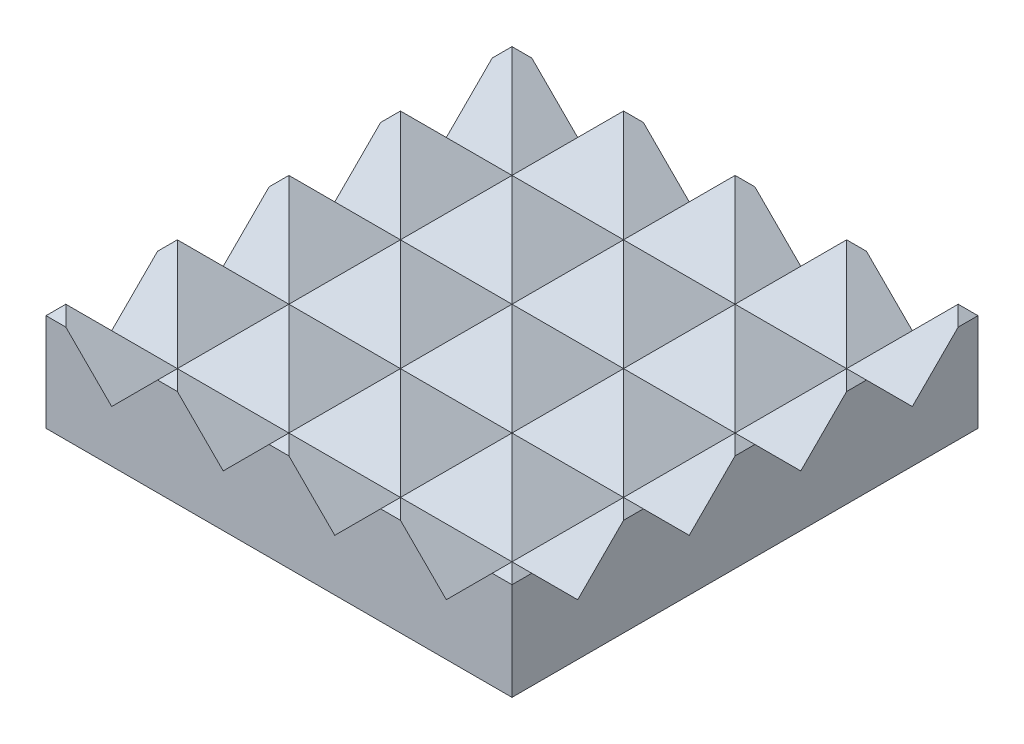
ISO-10303-21;
HEADER;
FILE_DESCRIPTION(('STEP AP214'),'2;1');
FILE_NAME('part.step','',(''),(''),'','','');
FILE_SCHEMA(('AUTOMOTIVE_DESIGN { 1 0 10303 214 1 1 1 1 }'));
ENDSEC;
DATA;
#1=APPLICATION_CONTEXT('core data for automotive mechanical design processes');
#2=APPLICATION_PROTOCOL_DEFINITION('international standard','automotive_design',2000,#1);
#3=PRODUCT_CONTEXT('',#1,'mechanical');
#4=PRODUCT('Part','Part','',(#3));
#5=PRODUCT_RELATED_PRODUCT_CATEGORY('part','',(#4));
#6=PRODUCT_DEFINITION_FORMATION('','',#4);
#7=PRODUCT_DEFINITION_CONTEXT('part definition',#1,'design');
#8=PRODUCT_DEFINITION('design','',#6,#7);
#9=PRODUCT_DEFINITION_SHAPE('','',#8);
#10=(LENGTH_UNIT() NAMED_UNIT(*) SI_UNIT(.MILLI.,.METRE.));
#11=(NAMED_UNIT(*) PLANE_ANGLE_UNIT() SI_UNIT($,.RADIAN.));
#12=(NAMED_UNIT(*) SI_UNIT($,.STERADIAN.) SOLID_ANGLE_UNIT());
#13=UNCERTAINTY_MEASURE_WITH_UNIT(LENGTH_MEASURE(1.E-05),#10,'distance_accuracy_value','');
#14=(GEOMETRIC_REPRESENTATION_CONTEXT(3) GLOBAL_UNCERTAINTY_ASSIGNED_CONTEXT((#13)) GLOBAL_UNIT_ASSIGNED_CONTEXT((#10,
#11,#12)) REPRESENTATION_CONTEXT('',''));
#15=CARTESIAN_POINT('',(0.,0.,0.));
#16=DIRECTION('',(0.,0.,1.));
#17=DIRECTION('',(1.,0.,0.));
#18=AXIS2_PLACEMENT_3D('',#15,#16,#17);
#19=CARTESIAN_POINT('',(-7.6,0.0699999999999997,-6.35));
#20=DIRECTION('',(0.707106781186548,-0.707106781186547,0.));
#21=DIRECTION('',(0.707106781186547,0.707106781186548,0.));
#22=AXIS2_PLACEMENT_3D('',#19,#20,#21);
#23=PLANE('',#22);
#24=DIRECTION('',(0.577350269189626,0.577350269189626,-0.577350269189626));
#25=VECTOR('',#24,1.);
#26=CARTESIAN_POINT('',(-7.00333333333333,0.666666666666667,-5.15666666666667));
#27=LINE('',#26,#25);
#28=CARTESIAN_POINT('',(-6.35,1.32,-5.81));
#29=VERTEX_POINT('',#28);
#30=CARTESIAN_POINT('',(-6.08,1.59,-6.08));
#31=VERTEX_POINT('',#30);
#32=EDGE_CURVE('E386',#29,#31,#27,.T.);
#33=ORIENTED_EDGE('',*,*,#32,.T.);
#34=DIRECTION('',(-0.577350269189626,-0.577350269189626,-0.577350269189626));
#35=VECTOR('',#34,1.);
#36=CARTESIAN_POINT('',(-7.18333333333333,0.486666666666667,-7.18333333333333));
#37=LINE('',#36,#35);
#38=CARTESIAN_POINT('',(-6.35,1.32,-6.35));
#39=VERTEX_POINT('',#38);
#40=EDGE_CURVE('E359',#31,#39,#37,.T.);
#41=ORIENTED_EDGE('',*,*,#40,.T.);
#42=DIRECTION('',(0.,0.,-1.));
#43=VECTOR('',#42,1.);
#44=CARTESIAN_POINT('',(-6.35,1.32,6.35));
#45=LINE('',#44,#43);
#46=EDGE_CURVE('E393',#29,#39,#45,.T.);
#47=ORIENTED_EDGE('',*,*,#46,.F.);
#48=EDGE_LOOP('',(#33,#41,#47));
#49=FACE_BOUND('',#48,.T.);
#50=ADVANCED_FACE('F37',(#49),#23,.F.);
#51=CARTESIAN_POINT('',(-4.56,0.0699999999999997,-6.35));
#52=DIRECTION('',(0.707106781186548,-0.707106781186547,0.));
#53=DIRECTION('',(0.707106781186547,0.707106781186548,0.));
#54=AXIS2_PLACEMENT_3D('',#51,#52,#53);
#55=PLANE('',#54);
#56=DIRECTION('',(0.577350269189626,0.577350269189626,-0.577350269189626));
#57=VECTOR('',#56,1.);
#58=CARTESIAN_POINT('',(-3.96333333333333,0.666666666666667,-5.15666666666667));
#59=LINE('',#58,#57);
#60=CARTESIAN_POINT('',(-4.56,0.0700000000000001,-4.56));
#61=VERTEX_POINT('',#60);
#62=CARTESIAN_POINT('',(-3.04,1.59,-6.08));
#63=VERTEX_POINT('',#62);
#64=EDGE_CURVE('E391',#61,#63,#59,.T.);
#65=ORIENTED_EDGE('',*,*,#64,.T.);
#66=DIRECTION('',(-0.577350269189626,-0.577350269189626,-0.577350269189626));
#67=VECTOR('',#66,1.);
#68=CARTESIAN_POINT('',(-4.14333333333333,0.486666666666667,-7.18333333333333));
#69=LINE('',#68,#67);
#70=CARTESIAN_POINT('',(-3.31,1.32,-6.35));
#71=VERTEX_POINT('',#70);
#72=EDGE_CURVE('E914',#63,#71,#69,.T.);
#73=ORIENTED_EDGE('',*,*,#72,.T.);
#74=DIRECTION('',(0.707106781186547,0.707106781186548,0.));
#75=VECTOR('',#74,1.);
#76=CARTESIAN_POINT('',(-4.56,0.0699999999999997,-6.35));
#77=LINE('',#76,#75);
#78=CARTESIAN_POINT('',(-4.56,0.0699999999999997,-6.35));
#79=VERTEX_POINT('',#78);
#80=EDGE_CURVE('E817',#79,#71,#77,.T.);
#81=ORIENTED_EDGE('',*,*,#80,.F.);
#82=DIRECTION('',(0.,0.,1.));
#83=VECTOR('',#82,1.);
#84=CARTESIAN_POINT('',(-4.56,0.0699999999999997,-6.35));
#85=LINE('',#84,#83);
#86=EDGE_CURVE('E829',#79,#61,#85,.T.);
#87=ORIENTED_EDGE('',*,*,#86,.T.);
#88=EDGE_LOOP('',(#65,#73,#81,#87));
#89=FACE_BOUND('',#88,.T.);
#90=ADVANCED_FACE('F1042',(#89),#55,.F.);
#91=CARTESIAN_POINT('',(-6.08,1.59,-6.35));
#92=DIRECTION('',(-0.707106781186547,-0.707106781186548,0.));
#93=DIRECTION('',(0.707106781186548,-0.707106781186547,0.));
#94=AXIS2_PLACEMENT_3D('',#91,#92,#93);
#95=PLANE('',#94);
#96=DIRECTION('',(0.707106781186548,-0.707106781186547,0.));
#97=VECTOR('',#96,1.);
#98=CARTESIAN_POINT('',(-6.08,1.59,-6.35));
#99=LINE('',#98,#97);
#100=CARTESIAN_POINT('',(-5.81,1.32,-6.35));
#101=VERTEX_POINT('',#100);
#102=EDGE_CURVE('E380',#101,#79,#99,.T.);
#103=ORIENTED_EDGE('',*,*,#102,.F.);
#104=DIRECTION('',(-0.577350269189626,0.577350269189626,0.577350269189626));
#105=VECTOR('',#104,1.);
#106=CARTESIAN_POINT('',(-5.99,1.5,-6.17));
#107=LINE('',#106,#105);
#108=EDGE_CURVE('E362',#101,#31,#107,.T.);
#109=ORIENTED_EDGE('',*,*,#108,.T.);
#110=DIRECTION('',(0.577350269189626,-0.577350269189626,0.577350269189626));
#111=VECTOR('',#110,1.);
#112=CARTESIAN_POINT('',(-6.17,1.68,-6.17));
#113=LINE('',#112,#111);
#114=EDGE_CURVE('E378',#31,#61,#113,.T.);
#115=ORIENTED_EDGE('',*,*,#114,.T.);
#116=ORIENTED_EDGE('',*,*,#86,.F.);
#117=EDGE_LOOP('',(#103,#109,#115,#116));
#118=FACE_BOUND('',#117,.T.);
#119=ADVANCED_FACE('F376',(#118),#95,.F.);
#120=CARTESIAN_POINT('',(-1.52,0.0699999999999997,-6.35));
#121=DIRECTION('',(0.707106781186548,-0.707106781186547,0.));
#122=DIRECTION('',(0.707106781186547,0.707106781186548,0.));
#123=AXIS2_PLACEMENT_3D('',#120,#121,#122);
#124=PLANE('',#123);
#125=DIRECTION('',(0.577350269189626,0.577350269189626,-0.577350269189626));
#126=VECTOR('',#125,1.);
#127=CARTESIAN_POINT('',(-0.923333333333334,0.666666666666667,-5.15666666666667));
#128=LINE('',#127,#126);
#129=CARTESIAN_POINT('',(-1.52,0.0700000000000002,-4.56));
#130=VERTEX_POINT('',#129);
#131=CARTESIAN_POINT('',(0.,1.59,-6.08));
#132=VERTEX_POINT('',#131);
#133=EDGE_CURVE('E1031',#130,#132,#128,.T.);
#134=ORIENTED_EDGE('',*,*,#133,.T.);
#135=DIRECTION('',(-0.577350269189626,-0.577350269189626,-0.577350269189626));
#136=VECTOR('',#135,1.);
#137=CARTESIAN_POINT('',(-1.10333333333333,0.486666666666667,-7.18333333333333));
#138=LINE('',#137,#136);
#139=CARTESIAN_POINT('',(-0.27,1.32,-6.35));
#140=VERTEX_POINT('',#139);
#141=EDGE_CURVE('E934',#132,#140,#138,.T.);
#142=ORIENTED_EDGE('',*,*,#141,.T.);
#143=DIRECTION('',(0.707106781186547,0.707106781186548,0.));
#144=VECTOR('',#143,1.);
#145=CARTESIAN_POINT('',(-1.52,0.0699999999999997,-6.35));
#146=LINE('',#145,#144);
#147=CARTESIAN_POINT('',(-1.52,0.0699999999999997,-6.35));
#148=VERTEX_POINT('',#147);
#149=EDGE_CURVE('E787',#148,#140,#146,.T.);
#150=ORIENTED_EDGE('',*,*,#149,.F.);
#151=DIRECTION('',(0.,0.,1.));
#152=VECTOR('',#151,1.);
#153=CARTESIAN_POINT('',(-1.52,0.0699999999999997,-6.35));
#154=LINE('',#153,#152);
#155=EDGE_CURVE('E794',#148,#130,#154,.T.);
#156=ORIENTED_EDGE('',*,*,#155,.T.);
#157=EDGE_LOOP('',(#134,#142,#150,#156));
#158=FACE_BOUND('',#157,.T.);
#159=ADVANCED_FACE('F1414',(#158),#124,.F.);
#160=CARTESIAN_POINT('',(-3.04,1.59,-6.35));
#161=DIRECTION('',(-0.707106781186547,-0.707106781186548,0.));
#162=DIRECTION('',(0.707106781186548,-0.707106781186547,0.));
#163=AXIS2_PLACEMENT_3D('',#160,#161,#162);
#164=PLANE('',#163);
#165=DIRECTION('',(0.707106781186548,-0.707106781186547,0.));
#166=VECTOR('',#165,1.);
#167=CARTESIAN_POINT('',(-3.04,1.59,-6.35));
#168=LINE('',#167,#166);
#169=CARTESIAN_POINT('',(-2.77,1.32,-6.35));
#170=VERTEX_POINT('',#169);
#171=EDGE_CURVE('E812',#170,#148,#168,.T.);
#172=ORIENTED_EDGE('',*,*,#171,.F.);
#173=DIRECTION('',(-0.577350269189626,0.577350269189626,0.577350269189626));
#174=VECTOR('',#173,1.);
#175=CARTESIAN_POINT('',(-2.95,1.5,-6.17));
#176=LINE('',#175,#174);
#177=EDGE_CURVE('E941',#170,#63,#176,.T.);
#178=ORIENTED_EDGE('',*,*,#177,.T.);
#179=DIRECTION('',(0.577350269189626,-0.577350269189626,0.577350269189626));
#180=VECTOR('',#179,1.);
#181=CARTESIAN_POINT('',(-3.13,1.68,-6.17));
#182=LINE('',#181,#180);
#183=EDGE_CURVE('E1034',#63,#130,#182,.T.);
#184=ORIENTED_EDGE('',*,*,#183,.T.);
#185=ORIENTED_EDGE('',*,*,#155,.F.);
#186=EDGE_LOOP('',(#172,#178,#184,#185));
#187=FACE_BOUND('',#186,.T.);
#188=ADVANCED_FACE('F1406',(#187),#164,.F.);
#189=CARTESIAN_POINT('',(1.52,0.0699999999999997,-6.35));
#190=DIRECTION('',(0.707106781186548,-0.707106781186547,0.));
#191=DIRECTION('',(0.707106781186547,0.707106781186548,0.));
#192=AXIS2_PLACEMENT_3D('',#189,#190,#191);
#193=PLANE('',#192);
#194=DIRECTION('',(0.577350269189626,0.577350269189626,-0.577350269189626));
#195=VECTOR('',#194,1.);
#196=CARTESIAN_POINT('',(2.11666666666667,0.666666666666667,-5.15666666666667));
#197=LINE('',#196,#195);
#198=CARTESIAN_POINT('',(1.52,0.0700000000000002,-4.56));
#199=VERTEX_POINT('',#198);
#200=CARTESIAN_POINT('',(3.04,1.59,-6.08));
#201=VERTEX_POINT('',#200);
#202=EDGE_CURVE('E1023',#199,#201,#197,.T.);
#203=ORIENTED_EDGE('',*,*,#202,.T.);
#204=DIRECTION('',(-0.577350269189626,-0.577350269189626,-0.577350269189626));
#205=VECTOR('',#204,1.);
#206=CARTESIAN_POINT('',(1.93666666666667,0.486666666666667,-7.18333333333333));
#207=LINE('',#206,#205);
#208=CARTESIAN_POINT('',(2.77,1.32,-6.35));
#209=VERTEX_POINT('',#208);
#210=EDGE_CURVE('E923',#201,#209,#207,.T.);
#211=ORIENTED_EDGE('',*,*,#210,.T.);
#212=DIRECTION('',(0.707106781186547,0.707106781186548,0.));
#213=VECTOR('',#212,1.);
#214=CARTESIAN_POINT('',(1.52,0.0699999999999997,-6.35));
#215=LINE('',#214,#213);
#216=CARTESIAN_POINT('',(1.52,0.0699999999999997,-6.35));
#217=VERTEX_POINT('',#216);
#218=EDGE_CURVE('E767',#217,#209,#215,.T.);
#219=ORIENTED_EDGE('',*,*,#218,.F.);
#220=DIRECTION('',(0.,0.,1.));
#221=VECTOR('',#220,1.);
#222=CARTESIAN_POINT('',(1.52,0.0699999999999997,-6.35));
#223=LINE('',#222,#221);
#224=EDGE_CURVE('E773',#217,#199,#223,.T.);
#225=ORIENTED_EDGE('',*,*,#224,.T.);
#226=EDGE_LOOP('',(#203,#211,#219,#225));
#227=FACE_BOUND('',#226,.T.);
#228=ADVANCED_FACE('F1398',(#227),#193,.F.);
#229=CARTESIAN_POINT('',(0.,1.59,-6.35));
#230=DIRECTION('',(-0.707106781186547,-0.707106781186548,0.));
#231=DIRECTION('',(0.707106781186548,-0.707106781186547,0.));
#232=AXIS2_PLACEMENT_3D('',#229,#230,#231);
#233=PLANE('',#232);
#234=DIRECTION('',(0.707106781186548,-0.707106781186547,0.));
#235=VECTOR('',#234,1.);
#236=CARTESIAN_POINT('',(0.,1.59,-6.35));
#237=LINE('',#236,#235);
#238=CARTESIAN_POINT('',(0.269999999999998,1.32,-6.35));
#239=VERTEX_POINT('',#238);
#240=EDGE_CURVE('E791',#239,#217,#237,.T.);
#241=ORIENTED_EDGE('',*,*,#240,.F.);
#242=DIRECTION('',(-0.577350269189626,0.577350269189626,0.577350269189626));
#243=VECTOR('',#242,1.);
#244=CARTESIAN_POINT('',(0.0899999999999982,1.5,-6.17));
#245=LINE('',#244,#243);
#246=EDGE_CURVE('E930',#239,#132,#245,.T.);
#247=ORIENTED_EDGE('',*,*,#246,.T.);
#248=DIRECTION('',(0.577350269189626,-0.577350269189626,0.577350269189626));
#249=VECTOR('',#248,1.);
#250=CARTESIAN_POINT('',(-0.0900000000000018,1.68,-6.17));
#251=LINE('',#250,#249);
#252=EDGE_CURVE('E1027',#132,#199,#251,.T.);
#253=ORIENTED_EDGE('',*,*,#252,.T.);
#254=ORIENTED_EDGE('',*,*,#224,.F.);
#255=EDGE_LOOP('',(#241,#247,#253,#254));
#256=FACE_BOUND('',#255,.T.);
#257=ADVANCED_FACE('F1403',(#256),#233,.F.);
#258=CARTESIAN_POINT('',(4.56,0.0699999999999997,-6.35));
#259=DIRECTION('',(0.707106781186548,-0.707106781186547,0.));
#260=DIRECTION('',(0.707106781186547,0.707106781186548,0.));
#261=AXIS2_PLACEMENT_3D('',#258,#259,#260);
#262=PLANE('',#261);
#263=DIRECTION('',(0.577350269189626,0.577350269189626,-0.577350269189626));
#264=VECTOR('',#263,1.);
#265=CARTESIAN_POINT('',(5.15666666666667,0.666666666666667,-5.15666666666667));
#266=LINE('',#265,#264);
#267=CARTESIAN_POINT('',(4.56,0.0700000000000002,-4.56));
#268=VERTEX_POINT('',#267);
#269=CARTESIAN_POINT('',(6.08,1.59,-6.08));
#270=VERTEX_POINT('',#269);
#271=EDGE_CURVE('E1016',#268,#270,#266,.T.);
#272=ORIENTED_EDGE('',*,*,#271,.T.);
#273=DIRECTION('',(-0.577350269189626,-0.577350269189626,-0.577350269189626));
#274=VECTOR('',#273,1.);
#275=CARTESIAN_POINT('',(4.97666666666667,0.486666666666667,-7.18333333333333));
#276=LINE('',#275,#274);
#277=CARTESIAN_POINT('',(5.81,1.32,-6.35));
#278=VERTEX_POINT('',#277);
#279=EDGE_CURVE('E911',#270,#278,#276,.T.);
#280=ORIENTED_EDGE('',*,*,#279,.T.);
#281=DIRECTION('',(0.707106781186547,0.707106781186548,0.));
#282=VECTOR('',#281,1.);
#283=CARTESIAN_POINT('',(4.56,0.0699999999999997,-6.35));
#284=LINE('',#283,#282);
#285=CARTESIAN_POINT('',(4.56,0.0699999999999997,-6.35));
#286=VERTEX_POINT('',#285);
#287=EDGE_CURVE('E750',#286,#278,#284,.T.);
#288=ORIENTED_EDGE('',*,*,#287,.F.);
#289=DIRECTION('',(0.,0.,1.));
#290=VECTOR('',#289,1.);
#291=CARTESIAN_POINT('',(4.56,0.0699999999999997,-6.35));
#292=LINE('',#291,#290);
#293=EDGE_CURVE('E753',#286,#268,#292,.T.);
#294=ORIENTED_EDGE('',*,*,#293,.T.);
#295=EDGE_LOOP('',(#272,#280,#288,#294));
#296=FACE_BOUND('',#295,.T.);
#297=ADVANCED_FACE('F1081',(#296),#262,.F.);
#298=CARTESIAN_POINT('',(3.04,1.59,-6.35));
#299=DIRECTION('',(-0.707106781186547,-0.707106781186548,0.));
#300=DIRECTION('',(0.707106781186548,-0.707106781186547,0.));
#301=AXIS2_PLACEMENT_3D('',#298,#299,#300);
#302=PLANE('',#301);
#303=DIRECTION('',(0.707106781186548,-0.707106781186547,0.));
#304=VECTOR('',#303,1.);
#305=CARTESIAN_POINT('',(3.04,1.59,-6.35));
#306=LINE('',#305,#304);
#307=CARTESIAN_POINT('',(3.31,1.32,-6.35));
#308=VERTEX_POINT('',#307);
#309=EDGE_CURVE('E771',#308,#286,#306,.T.);
#310=ORIENTED_EDGE('',*,*,#309,.F.);
#311=DIRECTION('',(-0.577350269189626,0.577350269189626,0.577350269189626));
#312=VECTOR('',#311,1.);
#313=CARTESIAN_POINT('',(3.13,1.5,-6.17));
#314=LINE('',#313,#312);
#315=EDGE_CURVE('E918',#308,#201,#314,.T.);
#316=ORIENTED_EDGE('',*,*,#315,.T.);
#317=DIRECTION('',(0.577350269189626,-0.577350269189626,0.577350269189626));
#318=VECTOR('',#317,1.);
#319=CARTESIAN_POINT('',(2.95,1.68,-6.17));
#320=LINE('',#319,#318);
#321=EDGE_CURVE('E1020',#201,#268,#320,.T.);
#322=ORIENTED_EDGE('',*,*,#321,.T.);
#323=ORIENTED_EDGE('',*,*,#293,.F.);
#324=EDGE_LOOP('',(#310,#316,#322,#323));
#325=FACE_BOUND('',#324,.T.);
#326=ADVANCED_FACE('F1085',(#325),#302,.F.);
#327=CARTESIAN_POINT('',(6.08,1.59,-6.35));
#328=DIRECTION('',(-0.707106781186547,-0.707106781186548,0.));
#329=DIRECTION('',(0.707106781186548,-0.707106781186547,0.));
#330=AXIS2_PLACEMENT_3D('',#327,#328,#329);
#331=PLANE('',#330);
#332=DIRECTION('',(0.,0.,1.));
#333=VECTOR('',#332,1.);
#334=CARTESIAN_POINT('',(6.35,1.32,6.35));
#335=LINE('',#334,#333);
#336=CARTESIAN_POINT('',(6.35,1.32,-6.35));
#337=VERTEX_POINT('',#336);
#338=CARTESIAN_POINT('',(6.35,1.32,-5.81));
#339=VERTEX_POINT('',#338);
#340=EDGE_CURVE('E746',#337,#339,#335,.T.);
#341=ORIENTED_EDGE('',*,*,#340,.F.);
#342=DIRECTION('',(-0.577350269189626,0.577350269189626,0.577350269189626));
#343=VECTOR('',#342,1.);
#344=CARTESIAN_POINT('',(6.17,1.5,-6.17));
#345=LINE('',#344,#343);
#346=EDGE_CURVE('E904',#337,#270,#345,.T.);
#347=ORIENTED_EDGE('',*,*,#346,.T.);
#348=DIRECTION('',(0.577350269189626,-0.577350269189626,0.577350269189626));
#349=VECTOR('',#348,1.);
#350=CARTESIAN_POINT('',(5.99,1.68,-6.17));
#351=LINE('',#350,#349);
#352=EDGE_CURVE('E1012',#270,#339,#351,.T.);
#353=ORIENTED_EDGE('',*,*,#352,.T.);
#354=EDGE_LOOP('',(#341,#347,#353));
#355=FACE_BOUND('',#354,.T.);
#356=ADVANCED_FACE('F1079',(#355),#331,.F.);
#357=DIRECTION('',(0.577350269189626,0.577350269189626,-0.577350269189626));
#358=VECTOR('',#357,1.);
#359=CARTESIAN_POINT('',(-5.99,1.68,-3.13));
#360=LINE('',#359,#358);
#361=CARTESIAN_POINT('',(-6.35,1.32,-2.77));
#362=VERTEX_POINT('',#361);
#363=CARTESIAN_POINT('',(-6.08,1.59,-3.04));
#364=VERTEX_POINT('',#363);
#365=EDGE_CURVE('E498',#362,#364,#360,.T.);
#366=ORIENTED_EDGE('',*,*,#365,.T.);
#367=DIRECTION('',(-0.577350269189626,-0.577350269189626,-0.577350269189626));
#368=VECTOR('',#367,1.);
#369=CARTESIAN_POINT('',(-8.19666666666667,-0.526666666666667,-5.15666666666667));
#370=LINE('',#369,#368);
#371=CARTESIAN_POINT('',(-6.35,1.32,-3.31));
#372=VERTEX_POINT('',#371);
#373=EDGE_CURVE('E1008',#364,#372,#370,.T.);
#374=ORIENTED_EDGE('',*,*,#373,.T.);
#375=EDGE_CURVE('E2342',#362,#372,#45,.T.);
#376=ORIENTED_EDGE('',*,*,#375,.F.);
#377=EDGE_LOOP('',(#366,#374,#376));
#378=FACE_BOUND('',#377,.T.);
#379=ADVANCED_FACE('F1231',(#378),#23,.F.);
#380=DIRECTION('',(0.577350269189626,0.577350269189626,-0.577350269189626));
#381=VECTOR('',#380,1.);
#382=CARTESIAN_POINT('',(-2.95,1.68,-3.13));
#383=LINE('',#382,#381);
#384=CARTESIAN_POINT('',(-4.56,0.0699999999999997,-1.52));
#385=VERTEX_POINT('',#384);
#386=CARTESIAN_POINT('',(-3.04,1.59,-3.04));
#387=VERTEX_POINT('',#386);
#388=EDGE_CURVE('E490',#385,#387,#383,.T.);
#389=ORIENTED_EDGE('',*,*,#388,.T.);
#390=DIRECTION('',(-0.577350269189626,-0.577350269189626,-0.577350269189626));
#391=VECTOR('',#390,1.);
#392=CARTESIAN_POINT('',(-5.15666666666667,-0.526666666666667,-5.15666666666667));
#393=LINE('',#392,#391);
#394=EDGE_CURVE('E1001',#387,#61,#393,.T.);
#395=ORIENTED_EDGE('',*,*,#394,.T.);
#396=EDGE_CURVE('E833',#61,#385,#85,.T.);
#397=ORIENTED_EDGE('',*,*,#396,.T.);
#398=EDGE_LOOP('',(#389,#395,#397));
#399=FACE_BOUND('',#398,.T.);
#400=ADVANCED_FACE('F1236',(#399),#55,.F.);
#401=ORIENTED_EDGE('',*,*,#396,.F.);
#402=DIRECTION('',(-0.577350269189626,0.577350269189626,0.577350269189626));
#403=VECTOR('',#402,1.);
#404=CARTESIAN_POINT('',(-4.97666666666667,0.486666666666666,-4.14333333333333));
#405=LINE('',#404,#403);
#406=EDGE_CURVE('E1004',#61,#364,#405,.T.);
#407=ORIENTED_EDGE('',*,*,#406,.T.);
#408=DIRECTION('',(0.577350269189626,-0.577350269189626,0.577350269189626));
#409=VECTOR('',#408,1.);
#410=CARTESIAN_POINT('',(-7.18333333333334,2.69333333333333,-4.14333333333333));
#411=LINE('',#410,#409);
#412=EDGE_CURVE('E494',#364,#385,#411,.T.);
#413=ORIENTED_EDGE('',*,*,#412,.T.);
#414=EDGE_LOOP('',(#401,#407,#413));
#415=FACE_BOUND('',#414,.T.);
#416=ADVANCED_FACE('F1969',(#415),#95,.F.);
#417=DIRECTION('',(0.577350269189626,0.577350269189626,-0.577350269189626));
#418=VECTOR('',#417,1.);
#419=CARTESIAN_POINT('',(0.0899999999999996,1.68,-3.13));
#420=LINE('',#419,#418);
#421=CARTESIAN_POINT('',(-1.52,0.07,-1.52));
#422=VERTEX_POINT('',#421);
#423=CARTESIAN_POINT('',(0.,1.59,-3.04));
#424=VERTEX_POINT('',#423);
#425=EDGE_CURVE('E482',#422,#424,#420,.T.);
#426=ORIENTED_EDGE('',*,*,#425,.T.);
#427=DIRECTION('',(-0.577350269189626,-0.577350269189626,-0.577350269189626));
#428=VECTOR('',#427,1.);
#429=CARTESIAN_POINT('',(-2.11666666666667,-0.526666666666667,-5.15666666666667));
#430=LINE('',#429,#428);
#431=EDGE_CURVE('E993',#424,#130,#430,.T.);
#432=ORIENTED_EDGE('',*,*,#431,.T.);
#433=EDGE_CURVE('E799',#130,#422,#154,.T.);
#434=ORIENTED_EDGE('',*,*,#433,.T.);
#435=EDGE_LOOP('',(#426,#432,#434));
#436=FACE_BOUND('',#435,.T.);
#437=ADVANCED_FACE('F1404',(#436),#124,.F.);
#438=ORIENTED_EDGE('',*,*,#433,.F.);
#439=DIRECTION('',(-0.577350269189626,0.577350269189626,0.577350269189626));
#440=VECTOR('',#439,1.);
#441=CARTESIAN_POINT('',(-1.93666666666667,0.486666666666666,-4.14333333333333));
#442=LINE('',#441,#440);
#443=EDGE_CURVE('E997',#130,#387,#442,.T.);
#444=ORIENTED_EDGE('',*,*,#443,.T.);
#445=DIRECTION('',(0.577350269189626,-0.577350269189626,0.577350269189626));
#446=VECTOR('',#445,1.);
#447=CARTESIAN_POINT('',(-4.14333333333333,2.69333333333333,-4.14333333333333));
#448=LINE('',#447,#446);
#449=EDGE_CURVE('E486',#387,#422,#448,.T.);
#450=ORIENTED_EDGE('',*,*,#449,.T.);
#451=EDGE_LOOP('',(#438,#444,#450));
#452=FACE_BOUND('',#451,.T.);
#453=ADVANCED_FACE('F1395',(#452),#164,.F.);
#454=DIRECTION('',(0.577350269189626,0.577350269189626,-0.577350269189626));
#455=VECTOR('',#454,1.);
#456=CARTESIAN_POINT('',(3.13,1.68,-3.13));
#457=LINE('',#456,#455);
#458=CARTESIAN_POINT('',(1.52,0.0700000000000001,-1.52));
#459=VERTEX_POINT('',#458);
#460=CARTESIAN_POINT('',(3.04,1.59,-3.04));
#461=VERTEX_POINT('',#460);
#462=EDGE_CURVE('E474',#459,#461,#457,.T.);
#463=ORIENTED_EDGE('',*,*,#462,.T.);
#464=DIRECTION('',(-0.577350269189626,-0.577350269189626,-0.577350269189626));
#465=VECTOR('',#464,1.);
#466=CARTESIAN_POINT('',(0.923333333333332,-0.526666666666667,-5.15666666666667));
#467=LINE('',#466,#465);
#468=EDGE_CURVE('E985',#461,#199,#467,.T.);
#469=ORIENTED_EDGE('',*,*,#468,.T.);
#470=EDGE_CURVE('E778',#199,#459,#223,.T.);
#471=ORIENTED_EDGE('',*,*,#470,.T.);
#472=EDGE_LOOP('',(#463,#469,#471));
#473=FACE_BOUND('',#472,.T.);
#474=ADVANCED_FACE('F1361',(#473),#193,.F.);
#475=ORIENTED_EDGE('',*,*,#470,.F.);
#476=DIRECTION('',(-0.577350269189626,0.577350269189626,0.577350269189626));
#477=VECTOR('',#476,1.);
#478=CARTESIAN_POINT('',(1.10333333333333,0.486666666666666,-4.14333333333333));
#479=LINE('',#478,#477);
#480=EDGE_CURVE('E989',#199,#424,#479,.T.);
#481=ORIENTED_EDGE('',*,*,#480,.T.);
#482=DIRECTION('',(0.577350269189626,-0.577350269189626,0.577350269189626));
#483=VECTOR('',#482,1.);
#484=CARTESIAN_POINT('',(-1.10333333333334,2.69333333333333,-4.14333333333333));
#485=LINE('',#484,#483);
#486=EDGE_CURVE('E478',#424,#459,#485,.T.);
#487=ORIENTED_EDGE('',*,*,#486,.T.);
#488=EDGE_LOOP('',(#475,#481,#487));
#489=FACE_BOUND('',#488,.T.);
#490=ADVANCED_FACE('F1380',(#489),#233,.F.);
#491=DIRECTION('',(0.577350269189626,0.577350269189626,-0.577350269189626));
#492=VECTOR('',#491,1.);
#493=CARTESIAN_POINT('',(6.17,1.68,-3.13));
#494=LINE('',#493,#492);
#495=CARTESIAN_POINT('',(4.56,0.07,-1.52));
#496=VERTEX_POINT('',#495);
#497=CARTESIAN_POINT('',(6.08,1.59,-3.04));
#498=VERTEX_POINT('',#497);
#499=EDGE_CURVE('E466',#496,#498,#494,.T.);
#500=ORIENTED_EDGE('',*,*,#499,.T.);
#501=DIRECTION('',(-0.577350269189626,-0.577350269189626,-0.577350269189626));
#502=VECTOR('',#501,1.);
#503=CARTESIAN_POINT('',(3.96333333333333,-0.526666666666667,-5.15666666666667));
#504=LINE('',#503,#502);
#505=EDGE_CURVE('E977',#498,#268,#504,.T.);
#506=ORIENTED_EDGE('',*,*,#505,.T.);
#507=EDGE_CURVE('E758',#268,#496,#292,.T.);
#508=ORIENTED_EDGE('',*,*,#507,.T.);
#509=EDGE_LOOP('',(#500,#506,#508));
#510=FACE_BOUND('',#509,.T.);
#511=ADVANCED_FACE('F1088',(#510),#262,.F.);
#512=ORIENTED_EDGE('',*,*,#507,.F.);
#513=DIRECTION('',(-0.577350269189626,0.577350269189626,0.577350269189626));
#514=VECTOR('',#513,1.);
#515=CARTESIAN_POINT('',(4.14333333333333,0.486666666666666,-4.14333333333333));
#516=LINE('',#515,#514);
#517=EDGE_CURVE('E981',#268,#461,#516,.T.);
#518=ORIENTED_EDGE('',*,*,#517,.T.);
#519=DIRECTION('',(0.577350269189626,-0.577350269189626,0.577350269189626));
#520=VECTOR('',#519,1.);
#521=CARTESIAN_POINT('',(1.93666666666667,2.69333333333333,-4.14333333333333));
#522=LINE('',#521,#520);
#523=EDGE_CURVE('E470',#461,#496,#522,.T.);
#524=ORIENTED_EDGE('',*,*,#523,.T.);
#525=EDGE_LOOP('',(#512,#518,#524));
#526=FACE_BOUND('',#525,.T.);
#527=ADVANCED_FACE('F1092',(#526),#302,.F.);
#528=CARTESIAN_POINT('',(6.35,1.32,-3.31));
#529=VERTEX_POINT('',#528);
#530=CARTESIAN_POINT('',(6.35,1.32,-2.77));
#531=VERTEX_POINT('',#530);
#532=EDGE_CURVE('E751',#529,#531,#335,.T.);
#533=ORIENTED_EDGE('',*,*,#532,.F.);
#534=DIRECTION('',(-0.577350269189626,0.577350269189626,0.577350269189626));
#535=VECTOR('',#534,1.);
#536=CARTESIAN_POINT('',(7.18333333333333,0.486666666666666,-4.14333333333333));
#537=LINE('',#536,#535);
#538=EDGE_CURVE('E964',#529,#498,#537,.T.);
#539=ORIENTED_EDGE('',*,*,#538,.T.);
#540=DIRECTION('',(0.577350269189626,-0.577350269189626,0.577350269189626));
#541=VECTOR('',#540,1.);
#542=CARTESIAN_POINT('',(4.97666666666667,2.69333333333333,-4.14333333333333));
#543=LINE('',#542,#541);
#544=EDGE_CURVE('E462',#498,#531,#543,.T.);
#545=ORIENTED_EDGE('',*,*,#544,.T.);
#546=EDGE_LOOP('',(#533,#539,#545));
#547=FACE_BOUND('',#546,.T.);
#548=ADVANCED_FACE('F1159',(#547),#331,.F.);
#549=DIRECTION('',(0.577350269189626,0.577350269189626,-0.577350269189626));
#550=VECTOR('',#549,1.);
#551=CARTESIAN_POINT('',(-4.97666666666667,2.69333333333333,-1.10333333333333));
#552=LINE('',#551,#550);
#553=CARTESIAN_POINT('',(-6.35,1.32,0.269999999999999));
#554=VERTEX_POINT('',#553);
#555=CARTESIAN_POINT('',(-6.08,1.59,0.));
#556=VERTEX_POINT('',#555);
#557=EDGE_CURVE('E600',#554,#556,#552,.T.);
#558=ORIENTED_EDGE('',*,*,#557,.T.);
#559=DIRECTION('',(-0.577350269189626,-0.577350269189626,-0.577350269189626));
#560=VECTOR('',#559,1.);
#561=CARTESIAN_POINT('',(-9.21,-1.54,-3.13));
#562=LINE('',#561,#560);
#563=CARTESIAN_POINT('',(-6.35,1.32,-0.269999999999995));
#564=VERTEX_POINT('',#563);
#565=EDGE_CURVE('E458',#556,#564,#562,.T.);
#566=ORIENTED_EDGE('',*,*,#565,.T.);
#567=EDGE_CURVE('E1272',#554,#564,#45,.T.);
#568=ORIENTED_EDGE('',*,*,#567,.F.);
#569=EDGE_LOOP('',(#558,#566,#568));
#570=FACE_BOUND('',#569,.T.);
#571=ADVANCED_FACE('F1241',(#570),#23,.F.);
#572=DIRECTION('',(0.577350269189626,0.577350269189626,-0.577350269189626));
#573=VECTOR('',#572,1.);
#574=CARTESIAN_POINT('',(-1.93666666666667,2.69333333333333,-1.10333333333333));
#575=LINE('',#574,#573);
#576=CARTESIAN_POINT('',(-4.56,0.0700000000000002,1.52));
#577=VERTEX_POINT('',#576);
#578=CARTESIAN_POINT('',(-3.04,1.59,0.));
#579=VERTEX_POINT('',#578);
#580=EDGE_CURVE('E592',#577,#579,#575,.T.);
#581=ORIENTED_EDGE('',*,*,#580,.T.);
#582=DIRECTION('',(-0.577350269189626,-0.577350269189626,-0.577350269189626));
#583=VECTOR('',#582,1.);
#584=CARTESIAN_POINT('',(-6.17,-1.54,-3.13));
#585=LINE('',#584,#583);
#586=EDGE_CURVE('E450',#579,#385,#585,.T.);
#587=ORIENTED_EDGE('',*,*,#586,.T.);
#588=EDGE_CURVE('E1316',#385,#577,#85,.T.);
#589=ORIENTED_EDGE('',*,*,#588,.T.);
#590=EDGE_LOOP('',(#581,#587,#589));
#591=FACE_BOUND('',#590,.T.);
#592=ADVANCED_FACE('F1259',(#591),#55,.F.);
#593=ORIENTED_EDGE('',*,*,#588,.F.);
#594=DIRECTION('',(-0.577350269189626,0.577350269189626,0.577350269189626));
#595=VECTOR('',#594,1.);
#596=CARTESIAN_POINT('',(-3.96333333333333,-0.526666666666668,-2.11666666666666));
#597=LINE('',#596,#595);
#598=EDGE_CURVE('E454',#385,#556,#597,.T.);
#599=ORIENTED_EDGE('',*,*,#598,.T.);
#600=DIRECTION('',(0.577350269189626,-0.577350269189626,0.577350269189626));
#601=VECTOR('',#600,1.);
#602=CARTESIAN_POINT('',(-8.19666666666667,3.70666666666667,-2.11666666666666));
#603=LINE('',#602,#601);
#604=EDGE_CURVE('E596',#556,#577,#603,.T.);
#605=ORIENTED_EDGE('',*,*,#604,.T.);
#606=EDGE_LOOP('',(#593,#599,#605));
#607=FACE_BOUND('',#606,.T.);
#608=ADVANCED_FACE('F1268',(#607),#95,.F.);
#609=DIRECTION('',(0.577350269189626,0.577350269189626,-0.577350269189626));
#610=VECTOR('',#609,1.);
#611=CARTESIAN_POINT('',(1.10333333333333,2.69333333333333,-1.10333333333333));
#612=LINE('',#611,#610);
#613=CARTESIAN_POINT('',(-1.52,0.0700000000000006,1.52));
#614=VERTEX_POINT('',#613);
#615=CARTESIAN_POINT('',(0.,1.59,0.));
#616=VERTEX_POINT('',#615);
#617=EDGE_CURVE('E584',#614,#616,#612,.T.);
#618=ORIENTED_EDGE('',*,*,#617,.T.);
#619=DIRECTION('',(-0.577350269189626,-0.577350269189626,-0.577350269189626));
#620=VECTOR('',#619,1.);
#621=CARTESIAN_POINT('',(-3.13,-1.54,-3.13));
#622=LINE('',#621,#620);
#623=EDGE_CURVE('E442',#616,#422,#622,.T.);
#624=ORIENTED_EDGE('',*,*,#623,.T.);
#625=EDGE_CURVE('E1435',#422,#614,#154,.T.);
#626=ORIENTED_EDGE('',*,*,#625,.T.);
#627=EDGE_LOOP('',(#618,#624,#626));
#628=FACE_BOUND('',#627,.T.);
#629=ADVANCED_FACE('F1391',(#628),#124,.F.);
#630=ORIENTED_EDGE('',*,*,#625,.F.);
#631=DIRECTION('',(-0.577350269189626,0.577350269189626,0.577350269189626));
#632=VECTOR('',#631,1.);
#633=CARTESIAN_POINT('',(-0.923333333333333,-0.526666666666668,-2.11666666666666));
#634=LINE('',#633,#632);
#635=EDGE_CURVE('E446',#422,#579,#634,.T.);
#636=ORIENTED_EDGE('',*,*,#635,.T.);
#637=DIRECTION('',(0.577350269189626,-0.577350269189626,0.577350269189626));
#638=VECTOR('',#637,1.);
#639=CARTESIAN_POINT('',(-5.15666666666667,3.70666666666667,-2.11666666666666));
#640=LINE('',#639,#638);
#641=EDGE_CURVE('E588',#579,#614,#640,.T.);
#642=ORIENTED_EDGE('',*,*,#641,.T.);
#643=EDGE_LOOP('',(#630,#636,#642));
#644=FACE_BOUND('',#643,.T.);
#645=ADVANCED_FACE('F1383',(#644),#164,.F.);
#646=DIRECTION('',(0.577350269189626,0.577350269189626,-0.577350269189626));
#647=VECTOR('',#646,1.);
#648=CARTESIAN_POINT('',(4.14333333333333,2.69333333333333,-1.10333333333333));
#649=LINE('',#648,#647);
#650=CARTESIAN_POINT('',(1.52,0.0700000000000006,1.52));
#651=VERTEX_POINT('',#650);
#652=CARTESIAN_POINT('',(3.04,1.59,0.));
#653=VERTEX_POINT('',#652);
#654=EDGE_CURVE('E576',#651,#653,#649,.T.);
#655=ORIENTED_EDGE('',*,*,#654,.T.);
#656=DIRECTION('',(-0.577350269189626,-0.577350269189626,-0.577350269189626));
#657=VECTOR('',#656,1.);
#658=CARTESIAN_POINT('',(-0.0900000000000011,-1.54,-3.13));
#659=LINE('',#658,#657);
#660=EDGE_CURVE('E434',#653,#459,#659,.T.);
#661=ORIENTED_EDGE('',*,*,#660,.T.);
#662=EDGE_CURVE('E1346',#459,#651,#223,.T.);
#663=ORIENTED_EDGE('',*,*,#662,.T.);
#664=EDGE_LOOP('',(#655,#661,#663));
#665=FACE_BOUND('',#664,.T.);
#666=ADVANCED_FACE('F1381',(#665),#193,.F.);
#667=ORIENTED_EDGE('',*,*,#662,.F.);
#668=DIRECTION('',(-0.577350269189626,0.577350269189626,0.577350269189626));
#669=VECTOR('',#668,1.);
#670=CARTESIAN_POINT('',(2.11666666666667,-0.526666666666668,-2.11666666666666));
#671=LINE('',#670,#669);
#672=EDGE_CURVE('E438',#459,#616,#671,.T.);
#673=ORIENTED_EDGE('',*,*,#672,.T.);
#674=DIRECTION('',(0.577350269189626,-0.577350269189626,0.577350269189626));
#675=VECTOR('',#674,1.);
#676=CARTESIAN_POINT('',(-2.11666666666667,3.70666666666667,-2.11666666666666));
#677=LINE('',#676,#675);
#678=EDGE_CURVE('E580',#616,#651,#677,.T.);
#679=ORIENTED_EDGE('',*,*,#678,.T.);
#680=EDGE_LOOP('',(#667,#673,#679));
#681=FACE_BOUND('',#680,.T.);
#682=ADVANCED_FACE('F1345',(#681),#233,.F.);
#683=DIRECTION('',(0.577350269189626,0.577350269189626,-0.577350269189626));
#684=VECTOR('',#683,1.);
#685=CARTESIAN_POINT('',(7.18333333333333,2.69333333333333,-1.10333333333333));
#686=LINE('',#685,#684);
#687=CARTESIAN_POINT('',(4.56,0.0700000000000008,1.52));
#688=VERTEX_POINT('',#687);
#689=CARTESIAN_POINT('',(6.08,1.59,0.));
#690=VERTEX_POINT('',#689);
#691=EDGE_CURVE('E568',#688,#690,#686,.T.);
#692=ORIENTED_EDGE('',*,*,#691,.T.);
#693=DIRECTION('',(-0.577350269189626,-0.577350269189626,-0.577350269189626));
#694=VECTOR('',#693,1.);
#695=CARTESIAN_POINT('',(2.95,-1.54,-3.13));
#696=LINE('',#695,#694);
#697=EDGE_CURVE('E426',#690,#496,#696,.T.);
#698=ORIENTED_EDGE('',*,*,#697,.T.);
#699=EDGE_CURVE('E1095',#496,#688,#292,.T.);
#700=ORIENTED_EDGE('',*,*,#699,.T.);
#701=EDGE_LOOP('',(#692,#698,#700));
#702=FACE_BOUND('',#701,.T.);
#703=ADVANCED_FACE('F1389',(#702),#262,.F.);
#704=ORIENTED_EDGE('',*,*,#699,.F.);
#705=DIRECTION('',(-0.577350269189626,0.577350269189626,0.577350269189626));
#706=VECTOR('',#705,1.);
#707=CARTESIAN_POINT('',(5.15666666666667,-0.526666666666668,-2.11666666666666));
#708=LINE('',#707,#706);
#709=EDGE_CURVE('E430',#496,#653,#708,.T.);
#710=ORIENTED_EDGE('',*,*,#709,.T.);
#711=DIRECTION('',(0.577350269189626,-0.577350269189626,0.577350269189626));
#712=VECTOR('',#711,1.);
#713=CARTESIAN_POINT('',(0.923333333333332,3.70666666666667,-2.11666666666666));
#714=LINE('',#713,#712);
#715=EDGE_CURVE('E572',#653,#688,#714,.T.);
#716=ORIENTED_EDGE('',*,*,#715,.T.);
#717=EDGE_LOOP('',(#704,#710,#716));
#718=FACE_BOUND('',#717,.T.);
#719=ADVANCED_FACE('F1260',(#718),#302,.F.);
#720=CARTESIAN_POINT('',(6.35,1.32,-0.269999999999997));
#721=VERTEX_POINT('',#720);
#722=CARTESIAN_POINT('',(6.35,1.32,0.27));
#723=VERTEX_POINT('',#722);
#724=EDGE_CURVE('E1144',#721,#723,#335,.T.);
#725=ORIENTED_EDGE('',*,*,#724,.F.);
#726=DIRECTION('',(-0.577350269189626,0.577350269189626,0.577350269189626));
#727=VECTOR('',#726,1.);
#728=CARTESIAN_POINT('',(8.19666666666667,-0.526666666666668,-2.11666666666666));
#729=LINE('',#728,#727);
#730=EDGE_CURVE('E416',#721,#690,#729,.T.);
#731=ORIENTED_EDGE('',*,*,#730,.T.);
#732=DIRECTION('',(0.577350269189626,-0.577350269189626,0.577350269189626));
#733=VECTOR('',#732,1.);
#734=CARTESIAN_POINT('',(3.96333333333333,3.70666666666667,-2.11666666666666));
#735=LINE('',#734,#733);
#736=EDGE_CURVE('E564',#690,#723,#735,.T.);
#737=ORIENTED_EDGE('',*,*,#736,.T.);
#738=EDGE_LOOP('',(#725,#731,#737));
#739=FACE_BOUND('',#738,.T.);
#740=ADVANCED_FACE('F1150',(#739),#331,.F.);
#741=DIRECTION('',(0.577350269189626,0.577350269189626,-0.577350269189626));
#742=VECTOR('',#741,1.);
#743=CARTESIAN_POINT('',(-3.96333333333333,3.70666666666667,0.923333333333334));
#744=LINE('',#743,#742);
#745=CARTESIAN_POINT('',(-6.35,1.32,3.31));
#746=VERTEX_POINT('',#745);
#747=CARTESIAN_POINT('',(-6.08,1.59,3.04));
#748=VERTEX_POINT('',#747);
#749=EDGE_CURVE('E698',#746,#748,#744,.T.);
#750=ORIENTED_EDGE('',*,*,#749,.T.);
#751=DIRECTION('',(-0.577350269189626,-0.577350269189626,-0.577350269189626));
#752=VECTOR('',#751,1.);
#753=CARTESIAN_POINT('',(-10.2233333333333,-2.55333333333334,-1.10333333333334));
#754=LINE('',#753,#752);
#755=CARTESIAN_POINT('',(-6.35,1.32,2.77));
#756=VERTEX_POINT('',#755);
#757=EDGE_CURVE('E560',#748,#756,#754,.T.);
#758=ORIENTED_EDGE('',*,*,#757,.T.);
#759=EDGE_CURVE('E839',#746,#756,#45,.T.);
#760=ORIENTED_EDGE('',*,*,#759,.F.);
#761=EDGE_LOOP('',(#750,#758,#760));
#762=FACE_BOUND('',#761,.T.);
#763=ADVANCED_FACE('F1244',(#762),#23,.F.);
#764=DIRECTION('',(0.577350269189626,0.577350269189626,-0.577350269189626));
#765=VECTOR('',#764,1.);
#766=CARTESIAN_POINT('',(-0.923333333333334,3.70666666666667,0.923333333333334));
#767=LINE('',#766,#765);
#768=CARTESIAN_POINT('',(-4.56,0.0700000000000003,4.56));
#769=VERTEX_POINT('',#768);
#770=CARTESIAN_POINT('',(-3.04,1.59,3.04));
#771=VERTEX_POINT('',#770);
#772=EDGE_CURVE('E690',#769,#771,#767,.T.);
#773=ORIENTED_EDGE('',*,*,#772,.T.);
#774=DIRECTION('',(-0.577350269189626,-0.577350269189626,-0.577350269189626));
#775=VECTOR('',#774,1.);
#776=CARTESIAN_POINT('',(-7.18333333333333,-2.55333333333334,-1.10333333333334));
#777=LINE('',#776,#775);
#778=EDGE_CURVE('E552',#771,#577,#777,.T.);
#779=ORIENTED_EDGE('',*,*,#778,.T.);
#780=EDGE_CURVE('E1301',#577,#769,#85,.T.);
#781=ORIENTED_EDGE('',*,*,#780,.T.);
#782=EDGE_LOOP('',(#773,#779,#781));
#783=FACE_BOUND('',#782,.T.);
#784=ADVANCED_FACE('F1249',(#783),#55,.F.);
#785=ORIENTED_EDGE('',*,*,#780,.F.);
#786=DIRECTION('',(-0.577350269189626,0.577350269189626,0.577350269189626));
#787=VECTOR('',#786,1.);
#788=CARTESIAN_POINT('',(-2.95,-1.54,-0.0900000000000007));
#789=LINE('',#788,#787);
#790=EDGE_CURVE('E556',#577,#748,#789,.T.);
#791=ORIENTED_EDGE('',*,*,#790,.T.);
#792=DIRECTION('',(0.577350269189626,-0.577350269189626,0.577350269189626));
#793=VECTOR('',#792,1.);
#794=CARTESIAN_POINT('',(-9.21,4.72,-0.0899999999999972));
#795=LINE('',#794,#793);
#796=EDGE_CURVE('E694',#748,#769,#795,.T.);
#797=ORIENTED_EDGE('',*,*,#796,.T.);
#798=EDGE_LOOP('',(#785,#791,#797));
#799=FACE_BOUND('',#798,.T.);
#800=ADVANCED_FACE('F1257',(#799),#95,.F.);
#801=DIRECTION('',(0.577350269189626,0.577350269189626,-0.577350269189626));
#802=VECTOR('',#801,1.);
#803=CARTESIAN_POINT('',(2.11666666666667,3.70666666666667,0.923333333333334));
#804=LINE('',#803,#802);
#805=CARTESIAN_POINT('',(-1.52,0.0700000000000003,4.56));
#806=VERTEX_POINT('',#805);
#807=CARTESIAN_POINT('',(0.,1.59,3.04));
#808=VERTEX_POINT('',#807);
#809=EDGE_CURVE('E682',#806,#808,#804,.T.);
#810=ORIENTED_EDGE('',*,*,#809,.T.);
#811=DIRECTION('',(-0.577350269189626,-0.577350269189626,-0.577350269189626));
#812=VECTOR('',#811,1.);
#813=CARTESIAN_POINT('',(-4.14333333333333,-2.55333333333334,-1.10333333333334));
#814=LINE('',#813,#812);
#815=EDGE_CURVE('E544',#808,#614,#814,.T.);
#816=ORIENTED_EDGE('',*,*,#815,.T.);
#817=EDGE_CURVE('E1433',#614,#806,#154,.T.);
#818=ORIENTED_EDGE('',*,*,#817,.T.);
#819=EDGE_LOOP('',(#810,#816,#818));
#820=FACE_BOUND('',#819,.T.);
#821=ADVANCED_FACE('F1425',(#820),#124,.F.);
#822=ORIENTED_EDGE('',*,*,#817,.F.);
#823=DIRECTION('',(-0.577350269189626,0.577350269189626,0.577350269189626));
#824=VECTOR('',#823,1.);
#825=CARTESIAN_POINT('',(0.0899999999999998,-1.54,-0.0900000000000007));
#826=LINE('',#825,#824);
#827=EDGE_CURVE('E548',#614,#771,#826,.T.);
#828=ORIENTED_EDGE('',*,*,#827,.T.);
#829=DIRECTION('',(0.577350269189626,-0.577350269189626,0.577350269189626));
#830=VECTOR('',#829,1.);
#831=CARTESIAN_POINT('',(-6.17,4.72,-0.0899999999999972));
#832=LINE('',#831,#830);
#833=EDGE_CURVE('E686',#771,#806,#832,.T.);
#834=ORIENTED_EDGE('',*,*,#833,.T.);
#835=EDGE_LOOP('',(#822,#828,#834));
#836=FACE_BOUND('',#835,.T.);
#837=ADVANCED_FACE('F1394',(#836),#164,.F.);
#838=DIRECTION('',(0.577350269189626,0.577350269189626,-0.577350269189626));
#839=VECTOR('',#838,1.);
#840=CARTESIAN_POINT('',(5.15666666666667,3.70666666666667,0.923333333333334));
#841=LINE('',#840,#839);
#842=CARTESIAN_POINT('',(1.52,0.0700000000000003,4.56));
#843=VERTEX_POINT('',#842);
#844=CARTESIAN_POINT('',(3.04,1.59,3.04));
#845=VERTEX_POINT('',#844);
#846=EDGE_CURVE('E674',#843,#845,#841,.T.);
#847=ORIENTED_EDGE('',*,*,#846,.T.);
#848=DIRECTION('',(-0.577350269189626,-0.577350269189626,-0.577350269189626));
#849=VECTOR('',#848,1.);
#850=CARTESIAN_POINT('',(-1.10333333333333,-2.55333333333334,-1.10333333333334));
#851=LINE('',#850,#849);
#852=EDGE_CURVE('E536',#845,#651,#851,.T.);
#853=ORIENTED_EDGE('',*,*,#852,.T.);
#854=EDGE_CURVE('E1184',#651,#843,#223,.T.);
#855=ORIENTED_EDGE('',*,*,#854,.T.);
#856=EDGE_LOOP('',(#847,#853,#855));
#857=FACE_BOUND('',#856,.T.);
#858=ADVANCED_FACE('F1349',(#857),#193,.F.);
#859=ORIENTED_EDGE('',*,*,#854,.F.);
#860=DIRECTION('',(-0.577350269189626,0.577350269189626,0.577350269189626));
#861=VECTOR('',#860,1.);
#862=CARTESIAN_POINT('',(3.13,-1.54,-0.0900000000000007));
#863=LINE('',#862,#861);
#864=EDGE_CURVE('E540',#651,#808,#863,.T.);
#865=ORIENTED_EDGE('',*,*,#864,.T.);
#866=DIRECTION('',(0.577350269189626,-0.577350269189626,0.577350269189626));
#867=VECTOR('',#866,1.);
#868=CARTESIAN_POINT('',(-3.13,4.72,-0.0899999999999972));
#869=LINE('',#868,#867);
#870=EDGE_CURVE('E678',#808,#843,#869,.T.);
#871=ORIENTED_EDGE('',*,*,#870,.T.);
#872=EDGE_LOOP('',(#859,#865,#871));
#873=FACE_BOUND('',#872,.T.);
#874=ADVANCED_FACE('F1352',(#873),#233,.F.);
#875=DIRECTION('',(0.577350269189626,0.577350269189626,-0.577350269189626));
#876=VECTOR('',#875,1.);
#877=CARTESIAN_POINT('',(8.19666666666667,3.70666666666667,0.923333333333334));
#878=LINE('',#877,#876);
#879=CARTESIAN_POINT('',(4.56,0.0700000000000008,4.56));
#880=VERTEX_POINT('',#879);
#881=CARTESIAN_POINT('',(6.08,1.59,3.04));
#882=VERTEX_POINT('',#881);
#883=EDGE_CURVE('E666',#880,#882,#878,.T.);
#884=ORIENTED_EDGE('',*,*,#883,.T.);
#885=DIRECTION('',(-0.577350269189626,-0.577350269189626,-0.577350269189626));
#886=VECTOR('',#885,1.);
#887=CARTESIAN_POINT('',(1.93666666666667,-2.55333333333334,-1.10333333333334));
#888=LINE('',#887,#886);
#889=EDGE_CURVE('E528',#882,#688,#888,.T.);
#890=ORIENTED_EDGE('',*,*,#889,.T.);
#891=EDGE_CURVE('E1098',#688,#880,#292,.T.);
#892=ORIENTED_EDGE('',*,*,#891,.T.);
#893=EDGE_LOOP('',(#884,#890,#892));
#894=FACE_BOUND('',#893,.T.);
#895=ADVANCED_FACE('F1473',(#894),#262,.F.);
#896=ORIENTED_EDGE('',*,*,#891,.F.);
#897=DIRECTION('',(-0.577350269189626,0.577350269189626,0.577350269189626));
#898=VECTOR('',#897,1.);
#899=CARTESIAN_POINT('',(6.17,-1.54,-0.0900000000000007));
#900=LINE('',#899,#898);
#901=EDGE_CURVE('E532',#688,#845,#900,.T.);
#902=ORIENTED_EDGE('',*,*,#901,.T.);
#903=DIRECTION('',(0.577350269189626,-0.577350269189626,0.577350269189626));
#904=VECTOR('',#903,1.);
#905=CARTESIAN_POINT('',(-0.0900000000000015,4.72,-0.0899999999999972));
#906=LINE('',#905,#904);
#907=EDGE_CURVE('E670',#845,#880,#906,.T.);
#908=ORIENTED_EDGE('',*,*,#907,.T.);
#909=EDGE_LOOP('',(#896,#902,#908));
#910=FACE_BOUND('',#909,.T.);
#911=ADVANCED_FACE('F1471',(#910),#302,.F.);
#912=CARTESIAN_POINT('',(6.35,1.32,2.77));
#913=VERTEX_POINT('',#912);
#914=CARTESIAN_POINT('',(6.35,1.32,3.31));
#915=VERTEX_POINT('',#914);
#916=EDGE_CURVE('E1131',#913,#915,#335,.T.);
#917=ORIENTED_EDGE('',*,*,#916,.F.);
#918=DIRECTION('',(-0.577350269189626,0.577350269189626,0.577350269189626));
#919=VECTOR('',#918,1.);
#920=CARTESIAN_POINT('',(9.21,-1.54,-0.0900000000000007));
#921=LINE('',#920,#919);
#922=EDGE_CURVE('E514',#913,#882,#921,.T.);
#923=ORIENTED_EDGE('',*,*,#922,.T.);
#924=DIRECTION('',(0.577350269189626,-0.577350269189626,0.577350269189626));
#925=VECTOR('',#924,1.);
#926=CARTESIAN_POINT('',(2.95,4.72,-0.0899999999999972));
#927=LINE('',#926,#925);
#928=EDGE_CURVE('E856',#882,#915,#927,.T.);
#929=ORIENTED_EDGE('',*,*,#928,.T.);
#930=EDGE_LOOP('',(#917,#923,#929));
#931=FACE_BOUND('',#930,.T.);
#932=ADVANCED_FACE('F1137',(#931),#331,.F.);
#933=CARTESIAN_POINT('',(-6.35,1.59,-6.35));
#934=DIRECTION('',(0.,0.,1.));
#935=DIRECTION('',(1.,0.,0.));
#936=AXIS2_PLACEMENT_3D('',#933,#934,#935);
#937=PLANE('',#936);
#938=DIRECTION('',(0.,-1.,0.));
#939=VECTOR('',#938,1.);
#940=CARTESIAN_POINT('',(6.35,1.59,-6.35));
#941=LINE('',#940,#939);
#942=CARTESIAN_POINT('',(6.35,-1.34,-6.35));
#943=VERTEX_POINT('',#942);
#944=EDGE_CURVE('E838',#337,#943,#941,.T.);
#945=ORIENTED_EDGE('',*,*,#944,.T.);
#946=DIRECTION('',(-1.,0.,0.));
#947=VECTOR('',#946,1.);
#948=CARTESIAN_POINT('',(-6.35,-1.34,-6.35));
#949=LINE('',#948,#947);
#950=CARTESIAN_POINT('',(-6.35,-1.34,-6.35));
#951=VERTEX_POINT('',#950);
#952=EDGE_CURVE('E877',#943,#951,#949,.T.);
#953=ORIENTED_EDGE('',*,*,#952,.T.);
#954=DIRECTION('',(0.,-1.,0.));
#955=VECTOR('',#954,1.);
#956=CARTESIAN_POINT('',(-6.35,1.59,-6.35));
#957=LINE('',#956,#955);
#958=EDGE_CURVE('E848',#39,#951,#957,.T.);
#959=ORIENTED_EDGE('',*,*,#958,.F.);
#960=DIRECTION('',(1.,0.,0.));
#961=VECTOR('',#960,1.);
#962=CARTESIAN_POINT('',(-6.35,1.32,-6.35));
#963=LINE('',#962,#961);
#964=EDGE_CURVE('E364',#39,#101,#963,.T.);
#965=ORIENTED_EDGE('',*,*,#964,.T.);
#966=ORIENTED_EDGE('',*,*,#102,.T.);
#967=ORIENTED_EDGE('',*,*,#80,.T.);
#968=EDGE_CURVE('E915',#71,#170,#963,.T.);
#969=ORIENTED_EDGE('',*,*,#968,.T.);
#970=ORIENTED_EDGE('',*,*,#171,.T.);
#971=ORIENTED_EDGE('',*,*,#149,.T.);
#972=EDGE_CURVE('E919',#140,#239,#963,.T.);
#973=ORIENTED_EDGE('',*,*,#972,.T.);
#974=ORIENTED_EDGE('',*,*,#240,.T.);
#975=ORIENTED_EDGE('',*,*,#218,.T.);
#976=EDGE_CURVE('E906',#209,#308,#963,.T.);
#977=ORIENTED_EDGE('',*,*,#976,.T.);
#978=ORIENTED_EDGE('',*,*,#309,.T.);
#979=ORIENTED_EDGE('',*,*,#287,.T.);
#980=EDGE_CURVE('E896',#278,#337,#963,.T.);
#981=ORIENTED_EDGE('',*,*,#980,.T.);
#982=EDGE_LOOP('',(#945,#953,#959,#965,#966,#967,#969,#970,#971,#973,#974,#975,#977,#978,#979,#981));
#983=FACE_BOUND('',#982,.T.);
#984=ADVANCED_FACE('F1479',(#983),#937,.F.);
#985=CARTESIAN_POINT('',(-6.35,1.59,6.35));
#986=DIRECTION('',(1.,0.,0.));
#987=DIRECTION('',(0.,0.,-1.));
#988=AXIS2_PLACEMENT_3D('',#985,#986,#987);
#989=PLANE('',#988);
#990=ORIENTED_EDGE('',*,*,#958,.T.);
#991=DIRECTION('',(0.,0.,1.));
#992=VECTOR('',#991,1.);
#993=CARTESIAN_POINT('',(-6.35,-1.34,6.35));
#994=LINE('',#993,#992);
#995=CARTESIAN_POINT('',(-6.35,-1.34,6.35));
#996=VERTEX_POINT('',#995);
#997=EDGE_CURVE('E860',#951,#996,#994,.T.);
#998=ORIENTED_EDGE('',*,*,#997,.T.);
#999=DIRECTION('',(0.,-1.,0.));
#1000=VECTOR('',#999,1.);
#1001=CARTESIAN_POINT('',(-6.35,1.59,6.35));
#1002=LINE('',#1001,#1000);
#1003=CARTESIAN_POINT('',(-6.35,1.32,6.35));
#1004=VERTEX_POINT('',#1003);
#1005=EDGE_CURVE('E845',#1004,#996,#1002,.T.);
#1006=ORIENTED_EDGE('',*,*,#1005,.F.);
#1007=CARTESIAN_POINT('',(-6.35,1.32,5.81));
#1008=VERTEX_POINT('',#1007);
#1009=EDGE_CURVE('E834',#1004,#1008,#45,.T.);
#1010=ORIENTED_EDGE('',*,*,#1009,.T.);
#1011=DIRECTION('',(0.,-0.707106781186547,-0.707106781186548));
#1012=VECTOR('',#1011,1.);
#1013=CARTESIAN_POINT('',(-6.35,0.0700000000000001,4.56));
#1014=LINE('',#1013,#1012);
#1015=CARTESIAN_POINT('',(-6.35,0.0700000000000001,4.56));
#1016=VERTEX_POINT('',#1015);
#1017=EDGE_CURVE('E605',#1008,#1016,#1014,.T.);
#1018=ORIENTED_EDGE('',*,*,#1017,.T.);
#1019=DIRECTION('',(0.,0.707106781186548,-0.707106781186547));
#1020=VECTOR('',#1019,1.);
#1021=CARTESIAN_POINT('',(-6.35,1.59,3.04));
#1022=LINE('',#1021,#1020);
#1023=EDGE_CURVE('E609',#1016,#746,#1022,.T.);
#1024=ORIENTED_EDGE('',*,*,#1023,.T.);
#1025=ORIENTED_EDGE('',*,*,#759,.T.);
#1026=DIRECTION('',(0.,-0.707106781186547,-0.707106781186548));
#1027=VECTOR('',#1026,1.);
#1028=CARTESIAN_POINT('',(-6.35,0.0700000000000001,1.52));
#1029=LINE('',#1028,#1027);
#1030=CARTESIAN_POINT('',(-6.35,0.0700000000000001,1.52));
#1031=VERTEX_POINT('',#1030);
#1032=EDGE_CURVE('E521',#756,#1031,#1029,.T.);
#1033=ORIENTED_EDGE('',*,*,#1032,.T.);
#1034=DIRECTION('',(0.,0.707106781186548,-0.707106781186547));
#1035=VECTOR('',#1034,1.);
#1036=CARTESIAN_POINT('',(-6.35,1.59,0.));
#1037=LINE('',#1036,#1035);
#1038=EDGE_CURVE('E502',#1031,#554,#1037,.T.);
#1039=ORIENTED_EDGE('',*,*,#1038,.T.);
#1040=ORIENTED_EDGE('',*,*,#567,.T.);
#1041=DIRECTION('',(0.,-0.707106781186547,-0.707106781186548));
#1042=VECTOR('',#1041,1.);
#1043=CARTESIAN_POINT('',(-6.35,0.0700000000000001,-1.52));
#1044=LINE('',#1043,#1042);
#1045=CARTESIAN_POINT('',(-6.35,0.0700000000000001,-1.52));
#1046=VERTEX_POINT('',#1045);
#1047=EDGE_CURVE('E401',#564,#1046,#1044,.T.);
#1048=ORIENTED_EDGE('',*,*,#1047,.T.);
#1049=DIRECTION('',(0.,0.707106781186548,-0.707106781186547));
#1050=VECTOR('',#1049,1.);
#1051=CARTESIAN_POINT('',(-6.35,1.59,-3.04));
#1052=LINE('',#1051,#1050);
#1053=EDGE_CURVE('E395',#1046,#362,#1052,.T.);
#1054=ORIENTED_EDGE('',*,*,#1053,.T.);
#1055=ORIENTED_EDGE('',*,*,#375,.T.);
#1056=DIRECTION('',(0.,-0.707106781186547,-0.707106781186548));
#1057=VECTOR('',#1056,1.);
#1058=CARTESIAN_POINT('',(-6.35,0.0700000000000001,-4.56));
#1059=LINE('',#1058,#1057);
#1060=CARTESIAN_POINT('',(-6.35,0.0700000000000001,-4.56));
#1061=VERTEX_POINT('',#1060);
#1062=EDGE_CURVE('E970',#372,#1061,#1059,.T.);
#1063=ORIENTED_EDGE('',*,*,#1062,.T.);
#1064=DIRECTION('',(0.,0.707106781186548,-0.707106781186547));
#1065=VECTOR('',#1064,1.);
#1066=CARTESIAN_POINT('',(-6.35,1.59,-6.08));
#1067=LINE('',#1066,#1065);
#1068=EDGE_CURVE('E370',#1061,#29,#1067,.T.);
#1069=ORIENTED_EDGE('',*,*,#1068,.T.);
#1070=ORIENTED_EDGE('',*,*,#46,.T.);
#1071=EDGE_LOOP('',(#990,#998,#1006,#1010,#1018,#1024,#1025,#1033,#1039,#1040,#1048,#1054,#1055,
#1063,#1069,#1070));
#1072=FACE_BOUND('',#1071,.T.);
#1073=ADVANCED_FACE('F1212',(#1072),#989,.F.);
#1074=CARTESIAN_POINT('',(-6.35,1.59,6.35));
#1075=DIRECTION('',(0.,0.,-1.));
#1076=DIRECTION('',(-1.,0.,0.));
#1077=AXIS2_PLACEMENT_3D('',#1074,#1075,#1076);
#1078=PLANE('',#1077);
#1079=ORIENTED_EDGE('',*,*,#1005,.T.);
#1080=DIRECTION('',(1.,0.,0.));
#1081=VECTOR('',#1080,1.);
#1082=CARTESIAN_POINT('',(-6.35,-1.34,6.35));
#1083=LINE('',#1082,#1081);
#1084=CARTESIAN_POINT('',(6.35,-1.34,6.35));
#1085=VERTEX_POINT('',#1084);
#1086=EDGE_CURVE('E11',#996,#1085,#1083,.T.);
#1087=ORIENTED_EDGE('',*,*,#1086,.T.);
#1088=DIRECTION('',(0.,-1.,0.));
#1089=VECTOR('',#1088,1.);
#1090=CARTESIAN_POINT('',(6.35,1.59,6.35));
#1091=LINE('',#1090,#1089);
#1092=CARTESIAN_POINT('',(6.35,1.32,6.35));
#1093=VERTEX_POINT('',#1092);
#1094=EDGE_CURVE('E842',#1093,#1085,#1091,.T.);
#1095=ORIENTED_EDGE('',*,*,#1094,.F.);
#1096=DIRECTION('',(-1.,0.,0.));
#1097=VECTOR('',#1096,1.);
#1098=CARTESIAN_POINT('',(-6.35,1.32,6.35));
#1099=LINE('',#1098,#1097);
#1100=CARTESIAN_POINT('',(5.81,1.32,6.35));
#1101=VERTEX_POINT('',#1100);
#1102=EDGE_CURVE('E706',#1093,#1101,#1099,.T.);
#1103=ORIENTED_EDGE('',*,*,#1102,.T.);
#1104=DIRECTION('',(0.707106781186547,0.707106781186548,0.));
#1105=VECTOR('',#1104,1.);
#1106=CARTESIAN_POINT('',(4.56,0.0699999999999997,6.35));
#1107=LINE('',#1106,#1105);
#1108=CARTESIAN_POINT('',(4.56,0.0699999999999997,6.35));
#1109=VERTEX_POINT('',#1108);
#1110=EDGE_CURVE('E757',#1109,#1101,#1107,.T.);
#1111=ORIENTED_EDGE('',*,*,#1110,.F.);
#1112=DIRECTION('',(0.707106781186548,-0.707106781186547,0.));
#1113=VECTOR('',#1112,1.);
#1114=CARTESIAN_POINT('',(3.04,1.59,6.35));
#1115=LINE('',#1114,#1113);
#1116=CARTESIAN_POINT('',(3.31,1.32,6.35));
#1117=VERTEX_POINT('',#1116);
#1118=EDGE_CURVE('E763',#1117,#1109,#1115,.T.);
#1119=ORIENTED_EDGE('',*,*,#1118,.F.);
#1120=CARTESIAN_POINT('',(2.77,1.32,6.35));
#1121=VERTEX_POINT('',#1120);
#1122=EDGE_CURVE('E712',#1117,#1121,#1099,.T.);
#1123=ORIENTED_EDGE('',*,*,#1122,.T.);
#1124=DIRECTION('',(0.707106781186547,0.707106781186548,0.));
#1125=VECTOR('',#1124,1.);
#1126=CARTESIAN_POINT('',(1.52,0.0699999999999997,6.35));
#1127=LINE('',#1126,#1125);
#1128=CARTESIAN_POINT('',(1.52,0.0699999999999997,6.35));
#1129=VERTEX_POINT('',#1128);
#1130=EDGE_CURVE('E777',#1129,#1121,#1127,.T.);
#1131=ORIENTED_EDGE('',*,*,#1130,.F.);
#1132=DIRECTION('',(0.707106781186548,-0.707106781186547,0.));
#1133=VECTOR('',#1132,1.);
#1134=CARTESIAN_POINT('',(0.,1.59,6.35));
#1135=LINE('',#1134,#1133);
#1136=CARTESIAN_POINT('',(0.269999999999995,1.32,6.35));
#1137=VERTEX_POINT('',#1136);
#1138=EDGE_CURVE('E783',#1137,#1129,#1135,.T.);
#1139=ORIENTED_EDGE('',*,*,#1138,.F.);
#1140=CARTESIAN_POINT('',(-0.269999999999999,1.32,6.35));
#1141=VERTEX_POINT('',#1140);
#1142=EDGE_CURVE('E728',#1137,#1141,#1099,.T.);
#1143=ORIENTED_EDGE('',*,*,#1142,.T.);
#1144=DIRECTION('',(0.707106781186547,0.707106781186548,0.));
#1145=VECTOR('',#1144,1.);
#1146=CARTESIAN_POINT('',(-1.52,0.0699999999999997,6.35));
#1147=LINE('',#1146,#1145);
#1148=CARTESIAN_POINT('',(-1.52,0.0699999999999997,6.35));
#1149=VERTEX_POINT('',#1148);
#1150=EDGE_CURVE('E798',#1149,#1141,#1147,.T.);
#1151=ORIENTED_EDGE('',*,*,#1150,.F.);
#1152=DIRECTION('',(0.707106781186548,-0.707106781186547,0.));
#1153=VECTOR('',#1152,1.);
#1154=CARTESIAN_POINT('',(-3.04,1.59,6.35));
#1155=LINE('',#1154,#1153);
#1156=CARTESIAN_POINT('',(-2.77,1.32,6.35));
#1157=VERTEX_POINT('',#1156);
#1158=EDGE_CURVE('E804',#1157,#1149,#1155,.T.);
#1159=ORIENTED_EDGE('',*,*,#1158,.F.);
#1160=CARTESIAN_POINT('',(-3.31,1.32,6.35));
#1161=VERTEX_POINT('',#1160);
#1162=EDGE_CURVE('E737',#1157,#1161,#1099,.T.);
#1163=ORIENTED_EDGE('',*,*,#1162,.T.);
#1164=DIRECTION('',(0.707106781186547,0.707106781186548,0.));
#1165=VECTOR('',#1164,1.);
#1166=CARTESIAN_POINT('',(-4.56,0.0699999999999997,6.35));
#1167=LINE('',#1166,#1165);
#1168=CARTESIAN_POINT('',(-4.56,0.0699999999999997,6.35));
#1169=VERTEX_POINT('',#1168);
#1170=EDGE_CURVE('E818',#1169,#1161,#1167,.T.);
#1171=ORIENTED_EDGE('',*,*,#1170,.F.);
#1172=DIRECTION('',(0.707106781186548,-0.707106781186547,0.));
#1173=VECTOR('',#1172,1.);
#1174=CARTESIAN_POINT('',(-6.08,1.59,6.35));
#1175=LINE('',#1174,#1173);
#1176=CARTESIAN_POINT('',(-5.81,1.32,6.35));
#1177=VERTEX_POINT('',#1176);
#1178=EDGE_CURVE('E808',#1177,#1169,#1175,.T.);
#1179=ORIENTED_EDGE('',*,*,#1178,.F.);
#1180=EDGE_CURVE('E711',#1177,#1004,#1099,.T.);
#1181=ORIENTED_EDGE('',*,*,#1180,.T.);
#1182=EDGE_LOOP('',(#1079,#1087,#1095,#1103,#1111,#1119,#1123,#1131,#1139,#1143,#1151,#1159,
#1163,#1171,#1179,#1181));
#1183=FACE_BOUND('',#1182,.T.);
#1184=ADVANCED_FACE('F1116',(#1183),#1078,.F.);
#1185=CARTESIAN_POINT('',(6.35,1.59,6.35));
#1186=DIRECTION('',(-1.,0.,0.));
#1187=DIRECTION('',(0.,0.,1.));
#1188=AXIS2_PLACEMENT_3D('',#1185,#1186,#1187);
#1189=PLANE('',#1188);
#1190=ORIENTED_EDGE('',*,*,#1094,.T.);
#1191=DIRECTION('',(0.,0.,-1.));
#1192=VECTOR('',#1191,1.);
#1193=CARTESIAN_POINT('',(6.35,-1.34,6.35));
#1194=LINE('',#1193,#1192);
#1195=EDGE_CURVE('E47',#1085,#943,#1194,.T.);
#1196=ORIENTED_EDGE('',*,*,#1195,.T.);
#1197=ORIENTED_EDGE('',*,*,#944,.F.);
#1198=ORIENTED_EDGE('',*,*,#340,.T.);
#1199=DIRECTION('',(0.,0.707106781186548,-0.707106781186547));
#1200=VECTOR('',#1199,1.);
#1201=CARTESIAN_POINT('',(6.35,1.59,-6.08));
#1202=LINE('',#1201,#1200);
#1203=CARTESIAN_POINT('',(6.35,0.0700000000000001,-4.56));
#1204=VERTEX_POINT('',#1203);
#1205=EDGE_CURVE('E961',#1204,#339,#1202,.T.);
#1206=ORIENTED_EDGE('',*,*,#1205,.F.);
#1207=DIRECTION('',(0.,-0.707106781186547,-0.707106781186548));
#1208=VECTOR('',#1207,1.);
#1209=CARTESIAN_POINT('',(6.35,0.0700000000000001,-4.56));
#1210=LINE('',#1209,#1208);
#1211=EDGE_CURVE('E958',#529,#1204,#1210,.T.);
#1212=ORIENTED_EDGE('',*,*,#1211,.F.);
#1213=ORIENTED_EDGE('',*,*,#532,.T.);
#1214=DIRECTION('',(0.,0.707106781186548,-0.707106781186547));
#1215=VECTOR('',#1214,1.);
#1216=CARTESIAN_POINT('',(6.35,1.59,-3.04));
#1217=LINE('',#1216,#1215);
#1218=CARTESIAN_POINT('',(6.35,0.0700000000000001,-1.52));
#1219=VERTEX_POINT('',#1218);
#1220=EDGE_CURVE('E412',#1219,#531,#1217,.T.);
#1221=ORIENTED_EDGE('',*,*,#1220,.F.);
#1222=DIRECTION('',(0.,-0.707106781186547,-0.707106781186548));
#1223=VECTOR('',#1222,1.);
#1224=CARTESIAN_POINT('',(6.35,0.0700000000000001,-1.52));
#1225=LINE('',#1224,#1223);
#1226=EDGE_CURVE('E409',#721,#1219,#1225,.T.);
#1227=ORIENTED_EDGE('',*,*,#1226,.F.);
#1228=ORIENTED_EDGE('',*,*,#724,.T.);
#1229=DIRECTION('',(0.,0.707106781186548,-0.707106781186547));
#1230=VECTOR('',#1229,1.);
#1231=CARTESIAN_POINT('',(6.35,1.59,0.));
#1232=LINE('',#1231,#1230);
#1233=CARTESIAN_POINT('',(6.35,0.0700000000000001,1.52));
#1234=VERTEX_POINT('',#1233);
#1235=EDGE_CURVE('E510',#1234,#723,#1232,.T.);
#1236=ORIENTED_EDGE('',*,*,#1235,.F.);
#1237=DIRECTION('',(0.,-0.707106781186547,-0.707106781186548));
#1238=VECTOR('',#1237,1.);
#1239=CARTESIAN_POINT('',(6.35,0.0700000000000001,1.52));
#1240=LINE('',#1239,#1238);
#1241=EDGE_CURVE('E507',#913,#1234,#1240,.T.);
#1242=ORIENTED_EDGE('',*,*,#1241,.F.);
#1243=ORIENTED_EDGE('',*,*,#916,.T.);
#1244=DIRECTION('',(0.,0.707106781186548,-0.707106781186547));
#1245=VECTOR('',#1244,1.);
#1246=CARTESIAN_POINT('',(6.35,1.59,3.04));
#1247=LINE('',#1246,#1245);
#1248=CARTESIAN_POINT('',(6.35,0.0700000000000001,4.56));
#1249=VERTEX_POINT('',#1248);
#1250=EDGE_CURVE('E610',#1249,#915,#1247,.T.);
#1251=ORIENTED_EDGE('',*,*,#1250,.F.);
#1252=DIRECTION('',(0.,-0.707106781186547,-0.707106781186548));
#1253=VECTOR('',#1252,1.);
#1254=CARTESIAN_POINT('',(6.35,0.0700000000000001,4.56));
#1255=LINE('',#1254,#1253);
#1256=CARTESIAN_POINT('',(6.35,1.32,5.81));
#1257=VERTEX_POINT('',#1256);
#1258=EDGE_CURVE('E604',#1257,#1249,#1255,.T.);
#1259=ORIENTED_EDGE('',*,*,#1258,.F.);
#1260=EDGE_CURVE('E752',#1257,#1093,#335,.T.);
#1261=ORIENTED_EDGE('',*,*,#1260,.T.);
#1262=EDGE_LOOP('',(#1190,#1196,#1197,#1198,#1206,#1212,#1213,#1221,#1227,#1228,#1236,#1242,
#1243,#1251,#1259,#1261));
#1263=FACE_BOUND('',#1262,.T.);
#1264=ADVANCED_FACE('F1077',(#1263),#1189,.F.);
#1265=CARTESIAN_POINT('',(6.35,-1.59,-6.35));
#1266=DIRECTION('',(0.,1.,0.));
#1267=DIRECTION('',(0.,0.,1.));
#1268=AXIS2_PLACEMENT_3D('',#1265,#1266,#1267);
#1269=PLANE('',#1268);
#1270=DIRECTION('',(-1.,0.,0.));
#1271=VECTOR('',#1270,1.);
#1272=CARTESIAN_POINT('',(6.35,-1.59,6.1));
#1273=LINE('',#1272,#1271);
#1274=CARTESIAN_POINT('',(6.1,-1.59,6.1));
#1275=VERTEX_POINT('',#1274);
#1276=CARTESIAN_POINT('',(-6.1,-1.59,6.1));
#1277=VERTEX_POINT('',#1276);
#1278=EDGE_CURVE('E864',#1275,#1277,#1273,.T.);
#1279=ORIENTED_EDGE('',*,*,#1278,.T.);
#1280=DIRECTION('',(0.,0.,-1.));
#1281=VECTOR('',#1280,1.);
#1282=CARTESIAN_POINT('',(-6.1,-1.59,-6.35));
#1283=LINE('',#1282,#1281);
#1284=CARTESIAN_POINT('',(-6.1,-1.59,-6.1));
#1285=VERTEX_POINT('',#1284);
#1286=EDGE_CURVE('E873',#1277,#1285,#1283,.T.);
#1287=ORIENTED_EDGE('',*,*,#1286,.T.);
#1288=DIRECTION('',(1.,0.,0.));
#1289=VECTOR('',#1288,1.);
#1290=CARTESIAN_POINT('',(6.35,-1.59,-6.1));
#1291=LINE('',#1290,#1289);
#1292=CARTESIAN_POINT('',(6.1,-1.59,-6.1));
#1293=VERTEX_POINT('',#1292);
#1294=EDGE_CURVE('E870',#1285,#1293,#1291,.T.);
#1295=ORIENTED_EDGE('',*,*,#1294,.T.);
#1296=DIRECTION('',(0.,0.,1.));
#1297=VECTOR('',#1296,1.);
#1298=CARTESIAN_POINT('',(6.1,-1.59,-6.35));
#1299=LINE('',#1298,#1297);
#1300=EDGE_CURVE('E867',#1293,#1275,#1299,.T.);
#1301=ORIENTED_EDGE('',*,*,#1300,.T.);
#1302=EDGE_LOOP('',(#1279,#1287,#1295,#1301));
#1303=FACE_BOUND('',#1302,.T.);
#1304=ADVANCED_FACE('F1243',(#1303),#1269,.F.);
#1305=DIRECTION('',(0.577350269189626,0.577350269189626,-0.577350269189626));
#1306=VECTOR('',#1305,1.);
#1307=CARTESIAN_POINT('',(-2.95,4.72,2.95));
#1308=LINE('',#1307,#1306);
#1309=CARTESIAN_POINT('',(-6.08,1.59,6.08));
#1310=VERTEX_POINT('',#1309);
#1311=EDGE_CURVE('E742',#1004,#1310,#1308,.T.);
#1312=ORIENTED_EDGE('',*,*,#1311,.T.);
#1313=DIRECTION('',(-0.577350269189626,-0.577350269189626,-0.577350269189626));
#1314=VECTOR('',#1313,1.);
#1315=CARTESIAN_POINT('',(-11.2366666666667,-3.56666666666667,0.92333333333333));
#1316=LINE('',#1315,#1314);
#1317=EDGE_CURVE('E662',#1310,#1008,#1316,.T.);
#1318=ORIENTED_EDGE('',*,*,#1317,.T.);
#1319=ORIENTED_EDGE('',*,*,#1009,.F.);
#1320=EDGE_LOOP('',(#1312,#1318,#1319));
#1321=FACE_BOUND('',#1320,.T.);
#1322=ADVANCED_FACE('F1209',(#1321),#23,.F.);
#1323=DIRECTION('',(0.577350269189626,0.577350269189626,-0.577350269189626));
#1324=VECTOR('',#1323,1.);
#1325=CARTESIAN_POINT('',(0.0899999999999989,4.72,2.95));
#1326=LINE('',#1325,#1324);
#1327=CARTESIAN_POINT('',(-3.04,1.59,6.08));
#1328=VERTEX_POINT('',#1327);
#1329=EDGE_CURVE('E733',#1161,#1328,#1326,.T.);
#1330=ORIENTED_EDGE('',*,*,#1329,.T.);
#1331=DIRECTION('',(-0.577350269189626,-0.577350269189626,-0.577350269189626));
#1332=VECTOR('',#1331,1.);
#1333=CARTESIAN_POINT('',(-8.19666666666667,-3.56666666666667,0.92333333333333));
#1334=LINE('',#1333,#1332);
#1335=EDGE_CURVE('E654',#1328,#769,#1334,.T.);
#1336=ORIENTED_EDGE('',*,*,#1335,.T.);
#1337=EDGE_CURVE('E822',#769,#1169,#85,.T.);
#1338=ORIENTED_EDGE('',*,*,#1337,.T.);
#1339=ORIENTED_EDGE('',*,*,#1170,.T.);
#1340=EDGE_LOOP('',(#1330,#1336,#1338,#1339));
#1341=FACE_BOUND('',#1340,.T.);
#1342=ADVANCED_FACE('F1200',(#1341),#55,.F.);
#1343=ORIENTED_EDGE('',*,*,#1337,.F.);
#1344=DIRECTION('',(-0.577350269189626,0.577350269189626,0.577350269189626));
#1345=VECTOR('',#1344,1.);
#1346=CARTESIAN_POINT('',(-1.93666666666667,-2.55333333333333,1.93666666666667));
#1347=LINE('',#1346,#1345);
#1348=EDGE_CURVE('E658',#769,#1310,#1347,.T.);
#1349=ORIENTED_EDGE('',*,*,#1348,.T.);
#1350=DIRECTION('',(0.577350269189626,-0.577350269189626,0.577350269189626));
#1351=VECTOR('',#1350,1.);
#1352=CARTESIAN_POINT('',(-10.2233333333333,5.73333333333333,1.93666666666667));
#1353=LINE('',#1352,#1351);
#1354=EDGE_CURVE('E738',#1310,#1177,#1353,.T.);
#1355=ORIENTED_EDGE('',*,*,#1354,.T.);
#1356=ORIENTED_EDGE('',*,*,#1178,.T.);
#1357=EDGE_LOOP('',(#1343,#1349,#1355,#1356));
#1358=FACE_BOUND('',#1357,.T.);
#1359=ADVANCED_FACE('F1203',(#1358),#95,.F.);
#1360=DIRECTION('',(0.577350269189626,0.577350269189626,-0.577350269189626));
#1361=VECTOR('',#1360,1.);
#1362=CARTESIAN_POINT('',(3.13,4.72,2.95));
#1363=LINE('',#1362,#1361);
#1364=CARTESIAN_POINT('',(0.,1.59,6.08));
#1365=VERTEX_POINT('',#1364);
#1366=EDGE_CURVE('E724',#1141,#1365,#1363,.T.);
#1367=ORIENTED_EDGE('',*,*,#1366,.T.);
#1368=DIRECTION('',(-0.577350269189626,-0.577350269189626,-0.577350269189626));
#1369=VECTOR('',#1368,1.);
#1370=CARTESIAN_POINT('',(-5.15666666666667,-3.56666666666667,0.92333333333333));
#1371=LINE('',#1370,#1369);
#1372=EDGE_CURVE('E646',#1365,#806,#1371,.T.);
#1373=ORIENTED_EDGE('',*,*,#1372,.T.);
#1374=EDGE_CURVE('E800',#806,#1149,#154,.T.);
#1375=ORIENTED_EDGE('',*,*,#1374,.T.);
#1376=ORIENTED_EDGE('',*,*,#1150,.T.);
#1377=EDGE_LOOP('',(#1367,#1373,#1375,#1376));
#1378=FACE_BOUND('',#1377,.T.);
#1379=ADVANCED_FACE('F1191',(#1378),#124,.F.);
#1380=ORIENTED_EDGE('',*,*,#1374,.F.);
#1381=DIRECTION('',(-0.577350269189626,0.577350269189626,0.577350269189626));
#1382=VECTOR('',#1381,1.);
#1383=CARTESIAN_POINT('',(1.10333333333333,-2.55333333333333,1.93666666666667));
#1384=LINE('',#1383,#1382);
#1385=EDGE_CURVE('E650',#806,#1328,#1384,.T.);
#1386=ORIENTED_EDGE('',*,*,#1385,.T.);
#1387=DIRECTION('',(0.577350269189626,-0.577350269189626,0.577350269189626));
#1388=VECTOR('',#1387,1.);
#1389=CARTESIAN_POINT('',(-7.18333333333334,5.73333333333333,1.93666666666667));
#1390=LINE('',#1389,#1388);
#1391=EDGE_CURVE('E729',#1328,#1157,#1390,.T.);
#1392=ORIENTED_EDGE('',*,*,#1391,.T.);
#1393=ORIENTED_EDGE('',*,*,#1158,.T.);
#1394=EDGE_LOOP('',(#1380,#1386,#1392,#1393));
#1395=FACE_BOUND('',#1394,.T.);
#1396=ADVANCED_FACE('F1194',(#1395),#164,.F.);
#1397=DIRECTION('',(0.577350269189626,0.577350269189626,-0.577350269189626));
#1398=VECTOR('',#1397,1.);
#1399=CARTESIAN_POINT('',(6.17,4.72,2.95));
#1400=LINE('',#1399,#1398);
#1401=CARTESIAN_POINT('',(3.04,1.59,6.08));
#1402=VERTEX_POINT('',#1401);
#1403=EDGE_CURVE('E716',#1121,#1402,#1400,.T.);
#1404=ORIENTED_EDGE('',*,*,#1403,.T.);
#1405=DIRECTION('',(-0.577350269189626,-0.577350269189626,-0.577350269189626));
#1406=VECTOR('',#1405,1.);
#1407=CARTESIAN_POINT('',(-2.11666666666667,-3.56666666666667,0.92333333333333));
#1408=LINE('',#1407,#1406);
#1409=EDGE_CURVE('E638',#1402,#843,#1408,.T.);
#1410=ORIENTED_EDGE('',*,*,#1409,.T.);
#1411=EDGE_CURVE('E779',#843,#1129,#223,.T.);
#1412=ORIENTED_EDGE('',*,*,#1411,.T.);
#1413=ORIENTED_EDGE('',*,*,#1130,.T.);
#1414=EDGE_LOOP('',(#1404,#1410,#1412,#1413));
#1415=FACE_BOUND('',#1414,.T.);
#1416=ADVANCED_FACE('F1180',(#1415),#193,.F.);
#1417=ORIENTED_EDGE('',*,*,#1411,.F.);
#1418=DIRECTION('',(-0.577350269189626,0.577350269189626,0.577350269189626));
#1419=VECTOR('',#1418,1.);
#1420=CARTESIAN_POINT('',(4.14333333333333,-2.55333333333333,1.93666666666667));
#1421=LINE('',#1420,#1419);
#1422=EDGE_CURVE('E642',#843,#1365,#1421,.T.);
#1423=ORIENTED_EDGE('',*,*,#1422,.T.);
#1424=DIRECTION('',(0.577350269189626,-0.577350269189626,0.577350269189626));
#1425=VECTOR('',#1424,1.);
#1426=CARTESIAN_POINT('',(-4.14333333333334,5.73333333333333,1.93666666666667));
#1427=LINE('',#1426,#1425);
#1428=EDGE_CURVE('E720',#1365,#1137,#1427,.T.);
#1429=ORIENTED_EDGE('',*,*,#1428,.T.);
#1430=ORIENTED_EDGE('',*,*,#1138,.T.);
#1431=EDGE_LOOP('',(#1417,#1423,#1429,#1430));
#1432=FACE_BOUND('',#1431,.T.);
#1433=ADVANCED_FACE('F1185',(#1432),#233,.F.);
#1434=DIRECTION('',(0.577350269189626,0.577350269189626,-0.577350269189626));
#1435=VECTOR('',#1434,1.);
#1436=CARTESIAN_POINT('',(9.21,4.72,2.95));
#1437=LINE('',#1436,#1435);
#1438=CARTESIAN_POINT('',(6.08,1.59,6.08));
#1439=VERTEX_POINT('',#1438);
#1440=EDGE_CURVE('E702',#1101,#1439,#1437,.T.);
#1441=ORIENTED_EDGE('',*,*,#1440,.T.);
#1442=DIRECTION('',(-0.577350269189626,-0.577350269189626,-0.577350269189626));
#1443=VECTOR('',#1442,1.);
#1444=CARTESIAN_POINT('',(0.923333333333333,-3.56666666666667,0.92333333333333));
#1445=LINE('',#1444,#1443);
#1446=EDGE_CURVE('E630',#1439,#880,#1445,.T.);
#1447=ORIENTED_EDGE('',*,*,#1446,.T.);
#1448=EDGE_CURVE('E759',#880,#1109,#292,.T.);
#1449=ORIENTED_EDGE('',*,*,#1448,.T.);
#1450=ORIENTED_EDGE('',*,*,#1110,.T.);
#1451=EDGE_LOOP('',(#1441,#1447,#1449,#1450));
#1452=FACE_BOUND('',#1451,.T.);
#1453=ADVANCED_FACE('F1109',(#1452),#262,.F.);
#1454=ORIENTED_EDGE('',*,*,#1448,.F.);
#1455=DIRECTION('',(-0.577350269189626,0.577350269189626,0.577350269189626));
#1456=VECTOR('',#1455,1.);
#1457=CARTESIAN_POINT('',(7.18333333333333,-2.55333333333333,1.93666666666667));
#1458=LINE('',#1457,#1456);
#1459=EDGE_CURVE('E634',#880,#1402,#1458,.T.);
#1460=ORIENTED_EDGE('',*,*,#1459,.T.);
#1461=DIRECTION('',(0.577350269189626,-0.577350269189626,0.577350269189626));
#1462=VECTOR('',#1461,1.);
#1463=CARTESIAN_POINT('',(-1.10333333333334,5.73333333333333,1.93666666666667));
#1464=LINE('',#1463,#1462);
#1465=EDGE_CURVE('E710',#1402,#1117,#1464,.T.);
#1466=ORIENTED_EDGE('',*,*,#1465,.T.);
#1467=ORIENTED_EDGE('',*,*,#1118,.T.);
#1468=EDGE_LOOP('',(#1454,#1460,#1466,#1467));
#1469=FACE_BOUND('',#1468,.T.);
#1470=ADVANCED_FACE('F1113',(#1469),#302,.F.);
#1471=ORIENTED_EDGE('',*,*,#1260,.F.);
#1472=DIRECTION('',(-0.577350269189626,0.577350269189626,0.577350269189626));
#1473=VECTOR('',#1472,1.);
#1474=CARTESIAN_POINT('',(10.2233333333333,-2.55333333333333,1.93666666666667));
#1475=LINE('',#1474,#1473);
#1476=EDGE_CURVE('E625',#1257,#1439,#1475,.T.);
#1477=ORIENTED_EDGE('',*,*,#1476,.T.);
#1478=DIRECTION('',(0.577350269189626,-0.577350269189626,0.577350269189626));
#1479=VECTOR('',#1478,1.);
#1480=CARTESIAN_POINT('',(1.93666666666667,5.73333333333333,1.93666666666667));
#1481=LINE('',#1480,#1479);
#1482=EDGE_CURVE('E852',#1439,#1093,#1481,.T.);
#1483=ORIENTED_EDGE('',*,*,#1482,.T.);
#1484=EDGE_LOOP('',(#1471,#1477,#1483));
#1485=FACE_BOUND('',#1484,.T.);
#1486=ADVANCED_FACE('F1123',(#1485),#331,.F.);
#1487=CARTESIAN_POINT('',(-6.35,1.59,6.08));
#1488=DIRECTION('',(0.,-0.707106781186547,-0.707106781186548));
#1489=DIRECTION('',(0.,0.707106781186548,-0.707106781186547));
#1490=AXIS2_PLACEMENT_3D('',#1487,#1488,#1489);
#1491=PLANE('',#1490);
#1492=ORIENTED_EDGE('',*,*,#1482,.F.);
#1493=ORIENTED_EDGE('',*,*,#1440,.F.);
#1494=ORIENTED_EDGE('',*,*,#1102,.F.);
#1495=EDGE_LOOP('',(#1492,#1493,#1494));
#1496=FACE_BOUND('',#1495,.T.);
#1497=ADVANCED_FACE('F1120',(#1496),#1491,.F.);
#1498=ORIENTED_EDGE('',*,*,#1465,.F.);
#1499=ORIENTED_EDGE('',*,*,#1403,.F.);
#1500=ORIENTED_EDGE('',*,*,#1122,.F.);
#1501=EDGE_LOOP('',(#1498,#1499,#1500));
#1502=FACE_BOUND('',#1501,.T.);
#1503=ADVANCED_FACE('F1515',(#1502),#1491,.F.);
#1504=ORIENTED_EDGE('',*,*,#1428,.F.);
#1505=ORIENTED_EDGE('',*,*,#1366,.F.);
#1506=ORIENTED_EDGE('',*,*,#1142,.F.);
#1507=EDGE_LOOP('',(#1504,#1505,#1506));
#1508=FACE_BOUND('',#1507,.T.);
#1509=ADVANCED_FACE('F1189',(#1508),#1491,.F.);
#1510=ORIENTED_EDGE('',*,*,#1391,.F.);
#1511=ORIENTED_EDGE('',*,*,#1329,.F.);
#1512=ORIENTED_EDGE('',*,*,#1162,.F.);
#1513=EDGE_LOOP('',(#1510,#1511,#1512));
#1514=FACE_BOUND('',#1513,.T.);
#1515=ADVANCED_FACE('F1198',(#1514),#1491,.F.);
#1516=ORIENTED_EDGE('',*,*,#1354,.F.);
#1517=ORIENTED_EDGE('',*,*,#1311,.F.);
#1518=ORIENTED_EDGE('',*,*,#1180,.F.);
#1519=EDGE_LOOP('',(#1516,#1517,#1518));
#1520=FACE_BOUND('',#1519,.T.);
#1521=ADVANCED_FACE('F1207',(#1520),#1491,.F.);
#1522=CARTESIAN_POINT('',(-6.35,0.0700000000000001,4.56));
#1523=DIRECTION('',(0.,-0.707106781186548,0.707106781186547));
#1524=DIRECTION('',(0.,-0.707106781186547,-0.707106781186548));
#1525=AXIS2_PLACEMENT_3D('',#1522,#1523,#1524);
#1526=PLANE('',#1525);
#1527=ORIENTED_EDGE('',*,*,#1476,.F.);
#1528=ORIENTED_EDGE('',*,*,#1258,.T.);
#1529=DIRECTION('',(1.,0.,0.));
#1530=VECTOR('',#1529,1.);
#1531=CARTESIAN_POINT('',(-6.35,0.0700000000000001,4.56));
#1532=LINE('',#1531,#1530);
#1533=EDGE_CURVE('E614',#880,#1249,#1532,.T.);
#1534=ORIENTED_EDGE('',*,*,#1533,.F.);
#1535=ORIENTED_EDGE('',*,*,#1446,.F.);
#1536=EDGE_LOOP('',(#1527,#1528,#1534,#1535));
#1537=FACE_BOUND('',#1536,.T.);
#1538=ADVANCED_FACE('F1126',(#1537),#1526,.F.);
#1539=CARTESIAN_POINT('',(-6.35,1.59,3.04));
#1540=DIRECTION('',(0.,-0.707106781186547,-0.707106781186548));
#1541=DIRECTION('',(0.,0.707106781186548,-0.707106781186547));
#1542=AXIS2_PLACEMENT_3D('',#1539,#1540,#1541);
#1543=PLANE('',#1542);
#1544=ORIENTED_EDGE('',*,*,#1533,.T.);
#1545=ORIENTED_EDGE('',*,*,#1250,.T.);
#1546=ORIENTED_EDGE('',*,*,#928,.F.);
#1547=ORIENTED_EDGE('',*,*,#883,.F.);
#1548=EDGE_LOOP('',(#1544,#1545,#1546,#1547));
#1549=FACE_BOUND('',#1548,.T.);
#1550=ADVANCED_FACE('F1134',(#1549),#1543,.F.);
#1551=ORIENTED_EDGE('',*,*,#1459,.F.);
#1552=EDGE_CURVE('E1459',#843,#880,#1532,.T.);
#1553=ORIENTED_EDGE('',*,*,#1552,.F.);
#1554=ORIENTED_EDGE('',*,*,#1409,.F.);
#1555=EDGE_LOOP('',(#1551,#1553,#1554));
#1556=FACE_BOUND('',#1555,.T.);
#1557=ADVANCED_FACE('F1469',(#1556),#1526,.F.);
#1558=ORIENTED_EDGE('',*,*,#1552,.T.);
#1559=ORIENTED_EDGE('',*,*,#907,.F.);
#1560=ORIENTED_EDGE('',*,*,#846,.F.);
#1561=EDGE_LOOP('',(#1558,#1559,#1560));
#1562=FACE_BOUND('',#1561,.T.);
#1563=ADVANCED_FACE('F1467',(#1562),#1543,.F.);
#1564=ORIENTED_EDGE('',*,*,#1422,.F.);
#1565=EDGE_CURVE('E1298',#806,#843,#1532,.T.);
#1566=ORIENTED_EDGE('',*,*,#1565,.F.);
#1567=ORIENTED_EDGE('',*,*,#1372,.F.);
#1568=EDGE_LOOP('',(#1564,#1566,#1567));
#1569=FACE_BOUND('',#1568,.T.);
#1570=ADVANCED_FACE('F1457',(#1569),#1526,.F.);
#1571=ORIENTED_EDGE('',*,*,#1565,.T.);
#1572=ORIENTED_EDGE('',*,*,#870,.F.);
#1573=ORIENTED_EDGE('',*,*,#809,.F.);
#1574=EDGE_LOOP('',(#1571,#1572,#1573));
#1575=FACE_BOUND('',#1574,.T.);
#1576=ADVANCED_FACE('F1455',(#1575),#1543,.F.);
#1577=ORIENTED_EDGE('',*,*,#1385,.F.);
#1578=EDGE_CURVE('E626',#769,#806,#1532,.T.);
#1579=ORIENTED_EDGE('',*,*,#1578,.F.);
#1580=ORIENTED_EDGE('',*,*,#1335,.F.);
#1581=EDGE_LOOP('',(#1577,#1579,#1580));
#1582=FACE_BOUND('',#1581,.T.);
#1583=ADVANCED_FACE('F1295',(#1582),#1526,.F.);
#1584=ORIENTED_EDGE('',*,*,#1578,.T.);
#1585=ORIENTED_EDGE('',*,*,#833,.F.);
#1586=ORIENTED_EDGE('',*,*,#772,.F.);
#1587=EDGE_LOOP('',(#1584,#1585,#1586));
#1588=FACE_BOUND('',#1587,.T.);
#1589=ADVANCED_FACE('F1293',(#1588),#1543,.F.);
#1590=ORIENTED_EDGE('',*,*,#1023,.F.);
#1591=EDGE_CURVE('E621',#1016,#769,#1532,.T.);
#1592=ORIENTED_EDGE('',*,*,#1591,.T.);
#1593=ORIENTED_EDGE('',*,*,#796,.F.);
#1594=ORIENTED_EDGE('',*,*,#749,.F.);
#1595=EDGE_LOOP('',(#1590,#1592,#1593,#1594));
#1596=FACE_BOUND('',#1595,.T.);
#1597=ADVANCED_FACE('F1285',(#1596),#1543,.F.);
#1598=ORIENTED_EDGE('',*,*,#1348,.F.);
#1599=ORIENTED_EDGE('',*,*,#1591,.F.);
#1600=ORIENTED_EDGE('',*,*,#1017,.F.);
#1601=ORIENTED_EDGE('',*,*,#1317,.F.);
#1602=EDGE_LOOP('',(#1598,#1599,#1600,#1601));
#1603=FACE_BOUND('',#1602,.T.);
#1604=ADVANCED_FACE('F1287',(#1603),#1526,.F.);
#1605=CARTESIAN_POINT('',(-6.35,0.0700000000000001,1.52));
#1606=DIRECTION('',(0.,-0.707106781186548,0.707106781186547));
#1607=DIRECTION('',(0.,-0.707106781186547,-0.707106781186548));
#1608=AXIS2_PLACEMENT_3D('',#1605,#1606,#1607);
#1609=PLANE('',#1608);
#1610=ORIENTED_EDGE('',*,*,#922,.F.);
#1611=ORIENTED_EDGE('',*,*,#1241,.T.);
#1612=DIRECTION('',(1.,0.,0.));
#1613=VECTOR('',#1612,1.);
#1614=CARTESIAN_POINT('',(-6.35,0.0700000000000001,1.52));
#1615=LINE('',#1614,#1613);
#1616=EDGE_CURVE('E509',#688,#1234,#1615,.T.);
#1617=ORIENTED_EDGE('',*,*,#1616,.F.);
#1618=ORIENTED_EDGE('',*,*,#889,.F.);
#1619=EDGE_LOOP('',(#1610,#1611,#1617,#1618));
#1620=FACE_BOUND('',#1619,.T.);
#1621=ADVANCED_FACE('F1139',(#1620),#1609,.F.);
#1622=CARTESIAN_POINT('',(-6.35,1.59,0.));
#1623=DIRECTION('',(0.,-0.707106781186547,-0.707106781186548));
#1624=DIRECTION('',(0.,0.707106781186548,-0.707106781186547));
#1625=AXIS2_PLACEMENT_3D('',#1622,#1623,#1624);
#1626=PLANE('',#1625);
#1627=ORIENTED_EDGE('',*,*,#1616,.T.);
#1628=ORIENTED_EDGE('',*,*,#1235,.T.);
#1629=ORIENTED_EDGE('',*,*,#736,.F.);
#1630=ORIENTED_EDGE('',*,*,#691,.F.);
#1631=EDGE_LOOP('',(#1627,#1628,#1629,#1630));
#1632=FACE_BOUND('',#1631,.T.);
#1633=ADVANCED_FACE('F1147',(#1632),#1626,.F.);
#1634=ORIENTED_EDGE('',*,*,#790,.F.);
#1635=EDGE_CURVE('E503',#1031,#577,#1615,.T.);
#1636=ORIENTED_EDGE('',*,*,#1635,.F.);
#1637=ORIENTED_EDGE('',*,*,#1032,.F.);
#1638=ORIENTED_EDGE('',*,*,#757,.F.);
#1639=EDGE_LOOP('',(#1634,#1636,#1637,#1638));
#1640=FACE_BOUND('',#1639,.T.);
#1641=ADVANCED_FACE('F1281',(#1640),#1609,.F.);
#1642=ORIENTED_EDGE('',*,*,#1038,.F.);
#1643=ORIENTED_EDGE('',*,*,#1635,.T.);
#1644=ORIENTED_EDGE('',*,*,#604,.F.);
#1645=ORIENTED_EDGE('',*,*,#557,.F.);
#1646=EDGE_LOOP('',(#1642,#1643,#1644,#1645));
#1647=FACE_BOUND('',#1646,.T.);
#1648=ADVANCED_FACE('F1276',(#1647),#1626,.F.);
#1649=ORIENTED_EDGE('',*,*,#901,.F.);
#1650=EDGE_CURVE('E1321',#651,#688,#1615,.T.);
#1651=ORIENTED_EDGE('',*,*,#1650,.F.);
#1652=ORIENTED_EDGE('',*,*,#852,.F.);
#1653=EDGE_LOOP('',(#1649,#1651,#1652));
#1654=FACE_BOUND('',#1653,.T.);
#1655=ADVANCED_FACE('F1342',(#1654),#1609,.F.);
#1656=ORIENTED_EDGE('',*,*,#1650,.T.);
#1657=ORIENTED_EDGE('',*,*,#715,.F.);
#1658=ORIENTED_EDGE('',*,*,#654,.F.);
#1659=EDGE_LOOP('',(#1656,#1657,#1658));
#1660=FACE_BOUND('',#1659,.T.);
#1661=ADVANCED_FACE('F1339',(#1660),#1626,.F.);
#1662=ORIENTED_EDGE('',*,*,#864,.F.);
#1663=EDGE_CURVE('E1313',#614,#651,#1615,.T.);
#1664=ORIENTED_EDGE('',*,*,#1663,.F.);
#1665=ORIENTED_EDGE('',*,*,#815,.F.);
#1666=EDGE_LOOP('',(#1662,#1664,#1665));
#1667=FACE_BOUND('',#1666,.T.);
#1668=ADVANCED_FACE('F1335',(#1667),#1609,.F.);
#1669=ORIENTED_EDGE('',*,*,#1663,.T.);
#1670=ORIENTED_EDGE('',*,*,#678,.F.);
#1671=ORIENTED_EDGE('',*,*,#617,.F.);
#1672=EDGE_LOOP('',(#1669,#1670,#1671));
#1673=FACE_BOUND('',#1672,.T.);
#1674=ADVANCED_FACE('F1333',(#1673),#1626,.F.);
#1675=EDGE_CURVE('E508',#577,#614,#1615,.T.);
#1676=ORIENTED_EDGE('',*,*,#1675,.T.);
#1677=ORIENTED_EDGE('',*,*,#641,.F.);
#1678=ORIENTED_EDGE('',*,*,#580,.F.);
#1679=EDGE_LOOP('',(#1676,#1677,#1678));
#1680=FACE_BOUND('',#1679,.T.);
#1681=ADVANCED_FACE('F1307',(#1680),#1626,.F.);
#1682=ORIENTED_EDGE('',*,*,#827,.F.);
#1683=ORIENTED_EDGE('',*,*,#1675,.F.);
#1684=ORIENTED_EDGE('',*,*,#778,.F.);
#1685=EDGE_LOOP('',(#1682,#1683,#1684));
#1686=FACE_BOUND('',#1685,.T.);
#1687=ADVANCED_FACE('F1310',(#1686),#1609,.F.);
#1688=CARTESIAN_POINT('',(-6.35,0.0700000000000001,-1.52));
#1689=DIRECTION('',(0.,-0.707106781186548,0.707106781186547));
#1690=DIRECTION('',(0.,-0.707106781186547,-0.707106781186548));
#1691=AXIS2_PLACEMENT_3D('',#1688,#1689,#1690);
#1692=PLANE('',#1691);
#1693=ORIENTED_EDGE('',*,*,#730,.F.);
#1694=ORIENTED_EDGE('',*,*,#1226,.T.);
#1695=DIRECTION('',(1.,0.,0.));
#1696=VECTOR('',#1695,1.);
#1697=CARTESIAN_POINT('',(-6.35,0.0700000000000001,-1.52));
#1698=LINE('',#1697,#1696);
#1699=EDGE_CURVE('E411',#496,#1219,#1698,.T.);
#1700=ORIENTED_EDGE('',*,*,#1699,.F.);
#1701=ORIENTED_EDGE('',*,*,#697,.F.);
#1702=EDGE_LOOP('',(#1693,#1694,#1700,#1701));
#1703=FACE_BOUND('',#1702,.T.);
#1704=ADVANCED_FACE('F1152',(#1703),#1692,.F.);
#1705=CARTESIAN_POINT('',(-6.35,1.59,-3.04));
#1706=DIRECTION('',(0.,-0.707106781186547,-0.707106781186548));
#1707=DIRECTION('',(0.,0.707106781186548,-0.707106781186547));
#1708=AXIS2_PLACEMENT_3D('',#1705,#1706,#1707);
#1709=PLANE('',#1708);
#1710=ORIENTED_EDGE('',*,*,#1699,.T.);
#1711=ORIENTED_EDGE('',*,*,#1220,.T.);
#1712=ORIENTED_EDGE('',*,*,#544,.F.);
#1713=ORIENTED_EDGE('',*,*,#499,.F.);
#1714=EDGE_LOOP('',(#1710,#1711,#1712,#1713));
#1715=FACE_BOUND('',#1714,.T.);
#1716=ADVANCED_FACE('F1157',(#1715),#1709,.F.);
#1717=ORIENTED_EDGE('',*,*,#598,.F.);
#1718=EDGE_CURVE('E405',#1046,#385,#1698,.T.);
#1719=ORIENTED_EDGE('',*,*,#1718,.F.);
#1720=ORIENTED_EDGE('',*,*,#1047,.F.);
#1721=ORIENTED_EDGE('',*,*,#565,.F.);
#1722=EDGE_LOOP('',(#1717,#1719,#1720,#1721));
#1723=FACE_BOUND('',#1722,.T.);
#1724=ADVANCED_FACE('F1622',(#1723),#1692,.F.);
#1725=ORIENTED_EDGE('',*,*,#1053,.F.);
#1726=ORIENTED_EDGE('',*,*,#1718,.T.);
#1727=ORIENTED_EDGE('',*,*,#412,.F.);
#1728=ORIENTED_EDGE('',*,*,#365,.F.);
#1729=EDGE_LOOP('',(#1725,#1726,#1727,#1728));
#1730=FACE_BOUND('',#1729,.T.);
#1731=ADVANCED_FACE('F1628',(#1730),#1709,.F.);
#1732=ORIENTED_EDGE('',*,*,#709,.F.);
#1733=EDGE_CURVE('E1372',#459,#496,#1698,.T.);
#1734=ORIENTED_EDGE('',*,*,#1733,.F.);
#1735=ORIENTED_EDGE('',*,*,#660,.F.);
#1736=EDGE_LOOP('',(#1732,#1734,#1735));
#1737=FACE_BOUND('',#1736,.T.);
#1738=ADVANCED_FACE('F1379',(#1737),#1692,.F.);
#1739=ORIENTED_EDGE('',*,*,#1733,.T.);
#1740=ORIENTED_EDGE('',*,*,#523,.F.);
#1741=ORIENTED_EDGE('',*,*,#462,.F.);
#1742=EDGE_LOOP('',(#1739,#1740,#1741));
#1743=FACE_BOUND('',#1742,.T.);
#1744=ADVANCED_FACE('F1376',(#1743),#1709,.F.);
#1745=ORIENTED_EDGE('',*,*,#672,.F.);
#1746=EDGE_CURVE('E1368',#422,#459,#1698,.T.);
#1747=ORIENTED_EDGE('',*,*,#1746,.F.);
#1748=ORIENTED_EDGE('',*,*,#623,.F.);
#1749=EDGE_LOOP('',(#1745,#1747,#1748));
#1750=FACE_BOUND('',#1749,.T.);
#1751=ADVANCED_FACE('F1373',(#1750),#1692,.F.);
#1752=ORIENTED_EDGE('',*,*,#1746,.T.);
#1753=ORIENTED_EDGE('',*,*,#486,.F.);
#1754=ORIENTED_EDGE('',*,*,#425,.F.);
#1755=EDGE_LOOP('',(#1752,#1753,#1754));
#1756=FACE_BOUND('',#1755,.T.);
#1757=ADVANCED_FACE('F1369',(#1756),#1709,.F.);
#1758=EDGE_CURVE('E410',#385,#422,#1698,.T.);
#1759=ORIENTED_EDGE('',*,*,#1758,.T.);
#1760=ORIENTED_EDGE('',*,*,#449,.F.);
#1761=ORIENTED_EDGE('',*,*,#388,.F.);
#1762=EDGE_LOOP('',(#1759,#1760,#1761));
#1763=FACE_BOUND('',#1762,.T.);
#1764=ADVANCED_FACE('F1449',(#1763),#1709,.F.);
#1765=ORIENTED_EDGE('',*,*,#635,.F.);
#1766=ORIENTED_EDGE('',*,*,#1758,.F.);
#1767=ORIENTED_EDGE('',*,*,#586,.F.);
#1768=EDGE_LOOP('',(#1765,#1766,#1767));
#1769=FACE_BOUND('',#1768,.T.);
#1770=ADVANCED_FACE('F1452',(#1769),#1692,.F.);
#1771=CARTESIAN_POINT('',(-6.35,0.0700000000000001,-4.56));
#1772=DIRECTION('',(0.,-0.707106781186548,0.707106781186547));
#1773=DIRECTION('',(0.,-0.707106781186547,-0.707106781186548));
#1774=AXIS2_PLACEMENT_3D('',#1771,#1772,#1773);
#1775=PLANE('',#1774);
#1776=ORIENTED_EDGE('',*,*,#538,.F.);
#1777=ORIENTED_EDGE('',*,*,#1211,.T.);
#1778=DIRECTION('',(1.,0.,0.));
#1779=VECTOR('',#1778,1.);
#1780=CARTESIAN_POINT('',(-6.35,0.0700000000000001,-4.56));
#1781=LINE('',#1780,#1779);
#1782=EDGE_CURVE('E960',#268,#1204,#1781,.T.);
#1783=ORIENTED_EDGE('',*,*,#1782,.F.);
#1784=ORIENTED_EDGE('',*,*,#505,.F.);
#1785=EDGE_LOOP('',(#1776,#1777,#1783,#1784));
#1786=FACE_BOUND('',#1785,.T.);
#1787=ADVANCED_FACE('F1075',(#1786),#1775,.F.);
#1788=CARTESIAN_POINT('',(-6.35,1.59,-6.08));
#1789=DIRECTION('',(0.,-0.707106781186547,-0.707106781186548));
#1790=DIRECTION('',(0.,0.707106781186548,-0.707106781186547));
#1791=AXIS2_PLACEMENT_3D('',#1788,#1789,#1790);
#1792=PLANE('',#1791);
#1793=ORIENTED_EDGE('',*,*,#1782,.T.);
#1794=ORIENTED_EDGE('',*,*,#1205,.T.);
#1795=ORIENTED_EDGE('',*,*,#352,.F.);
#1796=ORIENTED_EDGE('',*,*,#271,.F.);
#1797=EDGE_LOOP('',(#1793,#1794,#1795,#1796));
#1798=FACE_BOUND('',#1797,.T.);
#1799=ADVANCED_FACE('F1070',(#1798),#1792,.F.);
#1800=ORIENTED_EDGE('',*,*,#406,.F.);
#1801=EDGE_CURVE('E388',#1061,#61,#1781,.T.);
#1802=ORIENTED_EDGE('',*,*,#1801,.F.);
#1803=ORIENTED_EDGE('',*,*,#1062,.F.);
#1804=ORIENTED_EDGE('',*,*,#373,.F.);
#1805=EDGE_LOOP('',(#1800,#1802,#1803,#1804));
#1806=FACE_BOUND('',#1805,.T.);
#1807=ADVANCED_FACE('F1668',(#1806),#1775,.F.);
#1808=ORIENTED_EDGE('',*,*,#1068,.F.);
#1809=ORIENTED_EDGE('',*,*,#1801,.T.);
#1810=ORIENTED_EDGE('',*,*,#114,.F.);
#1811=ORIENTED_EDGE('',*,*,#32,.F.);
#1812=EDGE_LOOP('',(#1808,#1809,#1810,#1811));
#1813=FACE_BOUND('',#1812,.T.);
#1814=ADVANCED_FACE('F385',(#1813),#1792,.F.);
#1815=ORIENTED_EDGE('',*,*,#517,.F.);
#1816=EDGE_CURVE('E1055',#199,#268,#1781,.T.);
#1817=ORIENTED_EDGE('',*,*,#1816,.F.);
#1818=ORIENTED_EDGE('',*,*,#468,.F.);
#1819=EDGE_LOOP('',(#1815,#1817,#1818));
#1820=FACE_BOUND('',#1819,.T.);
#1821=ADVANCED_FACE('F1669',(#1820),#1775,.F.);
#1822=ORIENTED_EDGE('',*,*,#1816,.T.);
#1823=ORIENTED_EDGE('',*,*,#321,.F.);
#1824=ORIENTED_EDGE('',*,*,#202,.F.);
#1825=EDGE_LOOP('',(#1822,#1823,#1824));
#1826=FACE_BOUND('',#1825,.T.);
#1827=ADVANCED_FACE('F1675',(#1826),#1792,.F.);
#1828=ORIENTED_EDGE('',*,*,#480,.F.);
#1829=EDGE_CURVE('E1053',#130,#199,#1781,.T.);
#1830=ORIENTED_EDGE('',*,*,#1829,.F.);
#1831=ORIENTED_EDGE('',*,*,#431,.F.);
#1832=EDGE_LOOP('',(#1828,#1830,#1831));
#1833=FACE_BOUND('',#1832,.T.);
#1834=ADVANCED_FACE('F1690',(#1833),#1775,.F.);
#1835=ORIENTED_EDGE('',*,*,#1829,.T.);
#1836=ORIENTED_EDGE('',*,*,#252,.F.);
#1837=ORIENTED_EDGE('',*,*,#133,.F.);
#1838=EDGE_LOOP('',(#1835,#1836,#1837));
#1839=FACE_BOUND('',#1838,.T.);
#1840=ADVANCED_FACE('F1695',(#1839),#1792,.F.);
#1841=EDGE_CURVE('E959',#61,#130,#1781,.T.);
#1842=ORIENTED_EDGE('',*,*,#1841,.T.);
#1843=ORIENTED_EDGE('',*,*,#183,.F.);
#1844=ORIENTED_EDGE('',*,*,#64,.F.);
#1845=EDGE_LOOP('',(#1842,#1843,#1844));
#1846=FACE_BOUND('',#1845,.T.);
#1847=ADVANCED_FACE('F1047',(#1846),#1792,.F.);
#1848=ORIENTED_EDGE('',*,*,#443,.F.);
#1849=ORIENTED_EDGE('',*,*,#1841,.F.);
#1850=ORIENTED_EDGE('',*,*,#394,.F.);
#1851=EDGE_LOOP('',(#1848,#1849,#1850));
#1852=FACE_BOUND('',#1851,.T.);
#1853=ADVANCED_FACE('F1050',(#1852),#1775,.F.);
#1854=CARTESIAN_POINT('',(-6.35,0.0700000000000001,-7.6));
#1855=DIRECTION('',(0.,-0.707106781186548,0.707106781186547));
#1856=DIRECTION('',(0.,-0.707106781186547,-0.707106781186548));
#1857=AXIS2_PLACEMENT_3D('',#1854,#1855,#1856);
#1858=PLANE('',#1857);
#1859=ORIENTED_EDGE('',*,*,#346,.F.);
#1860=ORIENTED_EDGE('',*,*,#980,.F.);
#1861=ORIENTED_EDGE('',*,*,#279,.F.);
#1862=EDGE_LOOP('',(#1859,#1860,#1861));
#1863=FACE_BOUND('',#1862,.T.);
#1864=ADVANCED_FACE('F1713',(#1863),#1858,.F.);
#1865=ORIENTED_EDGE('',*,*,#315,.F.);
#1866=ORIENTED_EDGE('',*,*,#976,.F.);
#1867=ORIENTED_EDGE('',*,*,#210,.F.);
#1868=EDGE_LOOP('',(#1865,#1866,#1867));
#1869=FACE_BOUND('',#1868,.T.);
#1870=ADVANCED_FACE('F1718',(#1869),#1858,.F.);
#1871=ORIENTED_EDGE('',*,*,#246,.F.);
#1872=ORIENTED_EDGE('',*,*,#972,.F.);
#1873=ORIENTED_EDGE('',*,*,#141,.F.);
#1874=EDGE_LOOP('',(#1871,#1872,#1873));
#1875=FACE_BOUND('',#1874,.T.);
#1876=ADVANCED_FACE('F1725',(#1875),#1858,.F.);
#1877=ORIENTED_EDGE('',*,*,#177,.F.);
#1878=ORIENTED_EDGE('',*,*,#968,.F.);
#1879=ORIENTED_EDGE('',*,*,#72,.F.);
#1880=EDGE_LOOP('',(#1877,#1878,#1879));
#1881=FACE_BOUND('',#1880,.T.);
#1882=ADVANCED_FACE('F1731',(#1881),#1858,.F.);
#1883=ORIENTED_EDGE('',*,*,#108,.F.);
#1884=ORIENTED_EDGE('',*,*,#964,.F.);
#1885=ORIENTED_EDGE('',*,*,#40,.F.);
#1886=EDGE_LOOP('',(#1883,#1884,#1885));
#1887=FACE_BOUND('',#1886,.T.);
#1888=ADVANCED_FACE('F361',(#1887),#1858,.F.);
#1889=CARTESIAN_POINT('',(6.35,-1.34,6.35));
#1890=DIRECTION('',(-0.707106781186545,0.70710678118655,0.));
#1891=DIRECTION('',(-0.70710678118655,-0.707106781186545,0.));
#1892=AXIS2_PLACEMENT_3D('',#1889,#1890,#1891);
#1893=PLANE('',#1892);
#1894=DIRECTION('',(0.577350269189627,0.577350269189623,0.577350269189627));
#1895=VECTOR('',#1894,1.);
#1896=CARTESIAN_POINT('',(2.11666666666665,-5.57333333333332,2.11666666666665));
#1897=LINE('',#1896,#1895);
#1898=EDGE_CURVE('E887',#1275,#1085,#1897,.T.);
#1899=ORIENTED_EDGE('',*,*,#1898,.F.);
#1900=ORIENTED_EDGE('',*,*,#1300,.F.);
#1901=DIRECTION('',(0.577350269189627,0.577350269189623,-0.577350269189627));
#1902=VECTOR('',#1901,1.);
#1903=CARTESIAN_POINT('',(2.11666666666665,-5.57333333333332,-2.11666666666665));
#1904=LINE('',#1903,#1902);
#1905=EDGE_CURVE('E41',#943,#1293,#1904,.F.);
#1906=ORIENTED_EDGE('',*,*,#1905,.F.);
#1907=ORIENTED_EDGE('',*,*,#1195,.F.);
#1908=EDGE_LOOP('',(#1899,#1900,#1906,#1907));
#1909=FACE_BOUND('',#1908,.T.);
#1910=ADVANCED_FACE('F39',(#1909),#1893,.F.);
#1911=CARTESIAN_POINT('',(-6.35,-1.34,-6.35));
#1912=DIRECTION('',(0.,0.70710678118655,0.707106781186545));
#1913=DIRECTION('',(0.,-0.707106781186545,0.70710678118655));
#1914=AXIS2_PLACEMENT_3D('',#1911,#1912,#1913);
#1915=PLANE('',#1914);
#1916=ORIENTED_EDGE('',*,*,#1905,.T.);
#1917=ORIENTED_EDGE('',*,*,#1294,.F.);
#1918=DIRECTION('',(-0.577350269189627,0.577350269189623,-0.577350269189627));
#1919=VECTOR('',#1918,1.);
#1920=CARTESIAN_POINT('',(-6.35,-1.34,-6.35));
#1921=LINE('',#1920,#1919);
#1922=EDGE_CURVE('E885',#951,#1285,#1921,.F.);
#1923=ORIENTED_EDGE('',*,*,#1922,.F.);
#1924=ORIENTED_EDGE('',*,*,#952,.F.);
#1925=EDGE_LOOP('',(#1916,#1917,#1923,#1924));
#1926=FACE_BOUND('',#1925,.T.);
#1927=ADVANCED_FACE('F1222',(#1926),#1915,.F.);
#1928=CARTESIAN_POINT('',(-6.35,-1.34,6.35));
#1929=DIRECTION('',(0.,0.70710678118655,-0.707106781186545));
#1930=DIRECTION('',(0.,0.707106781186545,0.70710678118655));
#1931=AXIS2_PLACEMENT_3D('',#1928,#1929,#1930);
#1932=PLANE('',#1931);
#1933=ORIENTED_EDGE('',*,*,#1898,.T.);
#1934=ORIENTED_EDGE('',*,*,#1086,.F.);
#1935=DIRECTION('',(0.577350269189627,-0.577350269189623,-0.577350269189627));
#1936=VECTOR('',#1935,1.);
#1937=CARTESIAN_POINT('',(-6.35,-1.34,6.35));
#1938=LINE('',#1937,#1936);
#1939=EDGE_CURVE('E882',#1277,#996,#1938,.F.);
#1940=ORIENTED_EDGE('',*,*,#1939,.F.);
#1941=ORIENTED_EDGE('',*,*,#1278,.F.);
#1942=EDGE_LOOP('',(#1933,#1934,#1940,#1941));
#1943=FACE_BOUND('',#1942,.T.);
#1944=ADVANCED_FACE('F1220',(#1943),#1932,.F.);
#1945=CARTESIAN_POINT('',(-6.35,-1.34,6.35));
#1946=DIRECTION('',(0.707106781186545,0.70710678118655,0.));
#1947=DIRECTION('',(-0.70710678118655,0.707106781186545,0.));
#1948=AXIS2_PLACEMENT_3D('',#1945,#1946,#1947);
#1949=PLANE('',#1948);
#1950=ORIENTED_EDGE('',*,*,#1922,.T.);
#1951=ORIENTED_EDGE('',*,*,#1286,.F.);
#1952=ORIENTED_EDGE('',*,*,#1939,.T.);
#1953=ORIENTED_EDGE('',*,*,#997,.F.);
#1954=EDGE_LOOP('',(#1950,#1951,#1952,#1953));
#1955=FACE_BOUND('',#1954,.T.);
#1956=ADVANCED_FACE('F1217',(#1955),#1949,.F.);
#1957=CLOSED_SHELL('',(#50,#90,#119,#159,#188,#228,#257,#297,#326,#356,#379,#400,#416,#437,#453,
#474,#490,#511,#527,#548,#571,#592,#608,#629,#645,#666,#682,#703,#719,#740,#763,#784,#800,#821,
#837,#858,#874,#895,#911,#932,#984,#1073,#1184,#1264,#1304,#1322,#1342,#1359,#1379,#1396,#1416,
#1433,#1453,#1470,#1486,#1497,#1503,#1509,#1515,#1521,#1538,#1550,#1557,#1563,#1570,#1576,#1583,
#1589,#1597,#1604,#1621,#1633,#1641,#1648,#1655,#1661,#1668,#1674,#1681,#1687,#1704,#1716,#1724,
#1731,#1738,#1744,#1751,#1757,#1764,#1770,#1787,#1799,#1807,#1814,#1821,#1827,#1834,#1840,#1847,
#1853,#1864,#1870,#1876,#1882,#1888,#1910,#1927,#1944,#1956));
#1958=MANIFOLD_SOLID_BREP('B2',#1957);
#1959=ADVANCED_BREP_SHAPE_REPRESENTATION('',(#18,#1958),#14);
#1960=SHAPE_DEFINITION_REPRESENTATION(#9,#1959);
ENDSEC;
END-ISO-10303-21;
